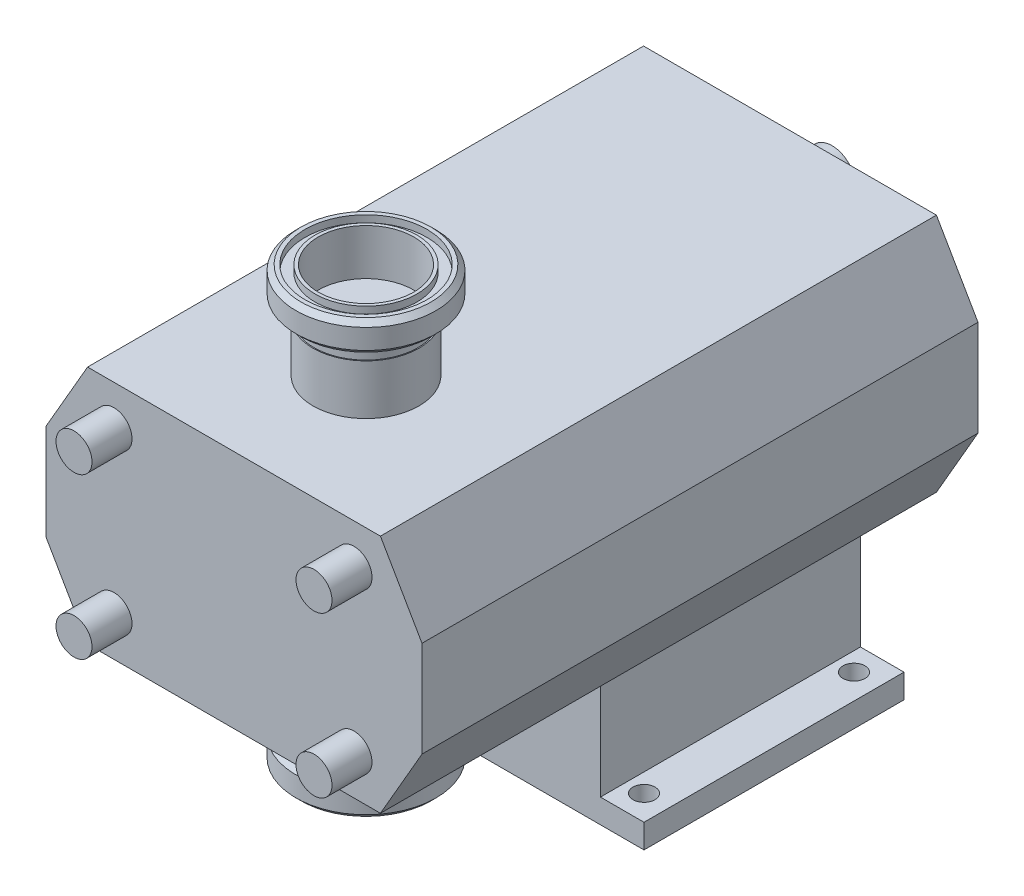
ISO-10303-21;
HEADER;
FILE_DESCRIPTION(('STEP AP214'),'2;1');
FILE_NAME('part.step','',(''),(''),'','','');
FILE_SCHEMA(('AUTOMOTIVE_DESIGN { 1 0 10303 214 1 1 1 1 }'));
ENDSEC;
DATA;
#1=APPLICATION_CONTEXT('core data for automotive mechanical design processes');
#2=APPLICATION_PROTOCOL_DEFINITION('international standard','automotive_design',2000,#1);
#3=PRODUCT_CONTEXT('',#1,'mechanical');
#4=PRODUCT('Part','Part','',(#3));
#5=PRODUCT_RELATED_PRODUCT_CATEGORY('part','',(#4));
#6=PRODUCT_DEFINITION_FORMATION('','',#4);
#7=PRODUCT_DEFINITION_CONTEXT('part definition',#1,'design');
#8=PRODUCT_DEFINITION('design','',#6,#7);
#9=PRODUCT_DEFINITION_SHAPE('','',#8);
#10=(LENGTH_UNIT() NAMED_UNIT(*) SI_UNIT(.MILLI.,.METRE.));
#11=(NAMED_UNIT(*) PLANE_ANGLE_UNIT() SI_UNIT($,.RADIAN.));
#12=(NAMED_UNIT(*) SI_UNIT($,.STERADIAN.) SOLID_ANGLE_UNIT());
#13=UNCERTAINTY_MEASURE_WITH_UNIT(LENGTH_MEASURE(1.E-05),#10,'distance_accuracy_value','');
#14=(GEOMETRIC_REPRESENTATION_CONTEXT(3) GLOBAL_UNCERTAINTY_ASSIGNED_CONTEXT((#13)) GLOBAL_UNIT_ASSIGNED_CONTEXT((#10,
#11,#12)) REPRESENTATION_CONTEXT('',''));
#15=CARTESIAN_POINT('',(0.,0.,0.));
#16=DIRECTION('',(0.,0.,1.));
#17=DIRECTION('',(1.,0.,0.));
#18=AXIS2_PLACEMENT_3D('',#15,#16,#17);
#19=CARTESIAN_POINT('',(25.267696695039,104.5,215.434167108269));
#20=DIRECTION('',(0.,1.,0.));
#21=DIRECTION('',(-0.134673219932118,0.,0.990890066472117));
#22=AXIS2_PLACEMENT_3D('',#19,#20,#21);
#23=PLANE('',#22);
#24=CARTESIAN_POINT('',(0.,104.5,212.));
#25=DIRECTION('',(0.,-1.,0.));
#26=DIRECTION('',(0.134673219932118,0.,-0.990890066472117));
#27=AXIS2_PLACEMENT_3D('',#24,#25,#26);
#28=CIRCLE('',#27,25.5);
#29=CARTESIAN_POINT('',(3.43416710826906,104.5,186.732303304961));
#30=VERTEX_POINT('',#29);
#31=EDGE_CURVE('P0_E57',#30,#30,#28,.T.);
#32=ORIENTED_EDGE('',*,*,#31,.T.);
#33=EDGE_LOOP('',(#32));
#34=FACE_BOUND('',#33,.T.);
#35=CARTESIAN_POINT('',(0.,104.5,212.));
#36=DIRECTION('',(0.,-1.,0.));
#37=DIRECTION('',(0.134673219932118,0.,-0.990890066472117));
#38=AXIS2_PLACEMENT_3D('',#35,#36,#37);
#39=CIRCLE('',#38,30.5);
#40=CARTESIAN_POINT('',(4.10753320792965,104.5,181.7778529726));
#41=VERTEX_POINT('',#40);
#42=EDGE_CURVE('P0_E9',#41,#41,#39,.T.);
#43=ORIENTED_EDGE('',*,*,#42,.F.);
#44=EDGE_LOOP('',(#43));
#45=FACE_BOUND('',#44,.T.);
#46=ADVANCED_FACE('P0_F14',(#34,#45),#23,.T.);
#47=CARTESIAN_POINT('',(0.,85.,212.));
#48=DIRECTION('',(0.,-1.,0.));
#49=DIRECTION('',(0.134673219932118,0.,-0.990890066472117));
#50=AXIS2_PLACEMENT_3D('',#47,#48,#49);
#51=CYLINDRICAL_SURFACE('',#50,30.5);
#52=ORIENTED_EDGE('',*,*,#42,.T.);
#53=EDGE_LOOP('',(#52));
#54=FACE_BOUND('',#53,.T.);
#55=CARTESIAN_POINT('',(0.,108.,212.));
#56=DIRECTION('',(0.,-1.,0.));
#57=DIRECTION('',(0.134673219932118,0.,-0.990890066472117));
#58=AXIS2_PLACEMENT_3D('',#55,#56,#57);
#59=CIRCLE('',#58,30.5);
#60=CARTESIAN_POINT('',(4.10753320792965,108.,181.7778529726));
#61=VERTEX_POINT('',#60);
#62=EDGE_CURVE('P0_E20',#61,#61,#59,.T.);
#63=ORIENTED_EDGE('',*,*,#62,.F.);
#64=EDGE_LOOP('',(#63));
#65=FACE_BOUND('',#64,.T.);
#66=ADVANCED_FACE('P0_F76',(#54,#65),#51,.F.);
#67=CARTESIAN_POINT('',(30.2221470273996,108.,216.10753320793));
#68=DIRECTION('',(0.,1.,0.));
#69=DIRECTION('',(-0.134673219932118,0.,0.990890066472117));
#70=AXIS2_PLACEMENT_3D('',#67,#68,#69);
#71=PLANE('',#70);
#72=ORIENTED_EDGE('',*,*,#62,.T.);
#73=EDGE_LOOP('',(#72));
#74=FACE_BOUND('',#73,.T.);
#75=CARTESIAN_POINT('',(0.,108.,212.));
#76=DIRECTION('',(0.,-1.,0.));
#77=DIRECTION('',(0.134673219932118,0.,-0.990890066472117));
#78=AXIS2_PLACEMENT_3D('',#75,#76,#77);
#79=CIRCLE('',#78,32.5);
#80=CARTESIAN_POINT('',(4.37687964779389,108.,179.796072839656));
#81=VERTEX_POINT('',#80);
#82=EDGE_CURVE('P0_E24',#81,#81,#79,.T.);
#83=ORIENTED_EDGE('',*,*,#82,.F.);
#84=EDGE_LOOP('',(#83));
#85=FACE_BOUND('',#84,.T.);
#86=ADVANCED_FACE('P0_F80',(#74,#85),#71,.T.);
#87=CARTESIAN_POINT('',(0.,105.5,212.));
#88=DIRECTION('',(0.,-1.,0.));
#89=DIRECTION('',(0.134673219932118,0.,-0.990890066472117));
#90=AXIS2_PLACEMENT_3D('',#87,#88,#89);
#91=CONICAL_SURFACE('',#90,35.,0.785398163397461);
#92=ORIENTED_EDGE('',*,*,#82,.T.);
#93=EDGE_LOOP('',(#92));
#94=FACE_BOUND('',#93,.T.);
#95=CARTESIAN_POINT('',(0.,105.5,212.));
#96=DIRECTION('',(0.,-1.,0.));
#97=DIRECTION('',(0.134673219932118,0.,-0.990890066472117));
#98=AXIS2_PLACEMENT_3D('',#95,#96,#97);
#99=CIRCLE('',#98,35.);
#100=CARTESIAN_POINT('',(4.71356269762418,105.5,177.318847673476));
#101=VERTEX_POINT('',#100);
#102=EDGE_CURVE('P0_E28',#101,#101,#99,.T.);
#103=ORIENTED_EDGE('',*,*,#102,.F.);
#104=EDGE_LOOP('',(#103));
#105=FACE_BOUND('',#104,.T.);
#106=ADVANCED_FACE('P0_F84',(#94,#105),#91,.T.);
#107=CARTESIAN_POINT('',(0.,85.,212.));
#108=DIRECTION('',(0.,-1.,0.));
#109=DIRECTION('',(0.134673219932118,0.,-0.990890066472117));
#110=AXIS2_PLACEMENT_3D('',#107,#108,#109);
#111=CYLINDRICAL_SURFACE('',#110,35.);
#112=ORIENTED_EDGE('',*,*,#102,.T.);
#113=EDGE_LOOP('',(#112));
#114=FACE_BOUND('',#113,.T.);
#115=CARTESIAN_POINT('',(0.,95.5,212.));
#116=DIRECTION('',(0.,-1.,0.));
#117=DIRECTION('',(0.134673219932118,0.,-0.990890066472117));
#118=AXIS2_PLACEMENT_3D('',#115,#116,#117);
#119=CIRCLE('',#118,35.);
#120=CARTESIAN_POINT('',(4.71356269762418,95.5,177.318847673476));
#121=VERTEX_POINT('',#120);
#122=EDGE_CURVE('P0_E33',#121,#121,#119,.T.);
#123=ORIENTED_EDGE('',*,*,#122,.F.);
#124=EDGE_LOOP('',(#123));
#125=FACE_BOUND('',#124,.T.);
#126=ADVANCED_FACE('P0_F90',(#114,#125),#111,.T.);
#127=CARTESIAN_POINT('',(0.,93.,212.));
#128=DIRECTION('',(0.,1.,0.));
#129=DIRECTION('',(-0.134673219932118,0.,0.990890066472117));
#130=AXIS2_PLACEMENT_3D('',#127,#128,#129);
#131=CONICAL_SURFACE('',#130,32.5,0.785398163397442);
#132=ORIENTED_EDGE('',*,*,#122,.T.);
#133=EDGE_LOOP('',(#132));
#134=FACE_BOUND('',#133,.T.);
#135=CARTESIAN_POINT('',(0.,93.,212.));
#136=DIRECTION('',(0.,-1.,0.));
#137=DIRECTION('',(0.134673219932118,0.,-0.990890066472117));
#138=AXIS2_PLACEMENT_3D('',#135,#136,#137);
#139=CIRCLE('',#138,32.5);
#140=CARTESIAN_POINT('',(4.37687964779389,93.,179.796072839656));
#141=VERTEX_POINT('',#140);
#142=EDGE_CURVE('P0_E36',#141,#141,#139,.T.);
#143=ORIENTED_EDGE('',*,*,#142,.F.);
#144=EDGE_LOOP('',(#143));
#145=FACE_BOUND('',#144,.T.);
#146=ADVANCED_FACE('P0_F94',(#134,#145),#131,.T.);
#147=CARTESIAN_POINT('',(32.2039271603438,93.,216.376879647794));
#148=DIRECTION('',(0.,-1.,0.));
#149=DIRECTION('',(0.134673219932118,0.,-0.990890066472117));
#150=AXIS2_PLACEMENT_3D('',#147,#148,#149);
#151=PLANE('',#150);
#152=ORIENTED_EDGE('',*,*,#142,.T.);
#153=EDGE_LOOP('',(#152));
#154=FACE_BOUND('',#153,.T.);
#155=CARTESIAN_POINT('',(0.,93.,212.));
#156=DIRECTION('',(0.,-1.,0.));
#157=DIRECTION('',(0.134673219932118,0.,-0.990890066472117));
#158=AXIS2_PLACEMENT_3D('',#155,#156,#157);
#159=CIRCLE('',#158,28.5);
#160=CARTESIAN_POINT('',(3.83818676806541,93.,183.759633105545));
#161=VERTEX_POINT('',#160);
#162=EDGE_CURVE('P0_E39',#161,#161,#159,.T.);
#163=ORIENTED_EDGE('',*,*,#162,.F.);
#164=EDGE_LOOP('',(#163));
#165=FACE_BOUND('',#164,.T.);
#166=ADVANCED_FACE('P0_F98',(#154,#165),#151,.T.);
#167=CARTESIAN_POINT('',(0.,90.5,212.));
#168=DIRECTION('',(0.,-1.,0.));
#169=DIRECTION('',(0.134673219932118,0.,-0.990890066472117));
#170=AXIS2_PLACEMENT_3D('',#167,#168,#169);
#171=TOROIDAL_SURFACE('',#170,28.5,2.5);
#172=ORIENTED_EDGE('',*,*,#162,.T.);
#173=EDGE_LOOP('',(#172));
#174=FACE_BOUND('',#173,.T.);
#175=CARTESIAN_POINT('',(0.,90.5,212.));
#176=DIRECTION('',(0.,-1.,0.));
#177=DIRECTION('',(0.134673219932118,0.,-0.990890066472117));
#178=AXIS2_PLACEMENT_3D('',#175,#176,#177);
#179=CIRCLE('',#178,26.);
#180=CARTESIAN_POINT('',(3.50150371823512,90.5,186.236858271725));
#181=VERTEX_POINT('',#180);
#182=EDGE_CURVE('P0_E42',#181,#181,#179,.T.);
#183=ORIENTED_EDGE('',*,*,#182,.F.);
#184=EDGE_LOOP('',(#183));
#185=FACE_BOUND('',#184,.T.);
#186=ADVANCED_FACE('P0_F102',(#174,#185),#171,.F.);
#187=CARTESIAN_POINT('',(0.,85.,212.));
#188=DIRECTION('',(0.,-1.,0.));
#189=DIRECTION('',(0.134673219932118,0.,-0.990890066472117));
#190=AXIS2_PLACEMENT_3D('',#187,#188,#189);
#191=CYLINDRICAL_SURFACE('',#190,26.);
#192=ORIENTED_EDGE('',*,*,#182,.T.);
#193=EDGE_LOOP('',(#192));
#194=FACE_BOUND('',#193,.T.);
#195=CARTESIAN_POINT('',(0.,85.,212.));
#196=DIRECTION('',(0.,-1.,0.));
#197=DIRECTION('',(0.134673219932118,0.,-0.990890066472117));
#198=AXIS2_PLACEMENT_3D('',#195,#196,#197);
#199=CIRCLE('',#198,26.);
#200=CARTESIAN_POINT('',(3.50150371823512,85.,186.236858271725));
#201=VERTEX_POINT('',#200);
#202=EDGE_CURVE('P0_E45',#201,#201,#199,.T.);
#203=ORIENTED_EDGE('',*,*,#202,.F.);
#204=EDGE_LOOP('',(#203));
#205=FACE_BOUND('',#204,.T.);
#206=ADVANCED_FACE('P0_F106',(#194,#205),#191,.T.);
#207=CARTESIAN_POINT('',(25.7631417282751,85.,215.501503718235));
#208=DIRECTION('',(0.,-1.,0.));
#209=DIRECTION('',(0.134673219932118,0.,-0.990890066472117));
#210=AXIS2_PLACEMENT_3D('',#207,#208,#209);
#211=PLANE('',#210);
#212=ORIENTED_EDGE('',*,*,#202,.T.);
#213=EDGE_LOOP('',(#212));
#214=FACE_BOUND('',#213,.T.);
#215=CARTESIAN_POINT('',(0.,85.,212.));
#216=DIRECTION('',(0.,-1.,0.));
#217=DIRECTION('',(0.134673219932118,0.,-0.990890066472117));
#218=AXIS2_PLACEMENT_3D('',#215,#216,#217);
#219=CIRCLE('',#218,23.9);
#220=CARTESIAN_POINT('',(3.21868995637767,85.,188.317727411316));
#221=VERTEX_POINT('',#220);
#222=EDGE_CURVE('P0_E48',#221,#221,#219,.T.);
#223=ORIENTED_EDGE('',*,*,#222,.F.);
#224=EDGE_LOOP('',(#223));
#225=FACE_BOUND('',#224,.T.);
#226=ADVANCED_FACE('P0_F110',(#214,#225),#211,.T.);
#227=CARTESIAN_POINT('',(0.,85.,212.));
#228=DIRECTION('',(0.,-1.,0.));
#229=DIRECTION('',(0.134673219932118,0.,-0.990890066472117));
#230=AXIS2_PLACEMENT_3D('',#227,#228,#229);
#231=CYLINDRICAL_SURFACE('',#230,23.9);
#232=ORIENTED_EDGE('',*,*,#222,.T.);
#233=EDGE_LOOP('',(#232));
#234=FACE_BOUND('',#233,.T.);
#235=CARTESIAN_POINT('',(0.,108.,212.));
#236=DIRECTION('',(0.,-1.,0.));
#237=DIRECTION('',(0.134673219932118,0.,-0.990890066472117));
#238=AXIS2_PLACEMENT_3D('',#235,#236,#237);
#239=CIRCLE('',#238,23.9);
#240=CARTESIAN_POINT('',(3.21868995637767,108.,188.317727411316));
#241=VERTEX_POINT('',#240);
#242=EDGE_CURVE('P0_E51',#241,#241,#239,.T.);
#243=ORIENTED_EDGE('',*,*,#242,.F.);
#244=EDGE_LOOP('',(#243));
#245=FACE_BOUND('',#244,.T.);
#246=ADVANCED_FACE('P0_F72',(#234,#245),#231,.F.);
#247=CARTESIAN_POINT('',(23.6822725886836,108.,215.218689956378));
#248=DIRECTION('',(0.,1.,0.));
#249=DIRECTION('',(-0.134673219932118,0.,0.990890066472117));
#250=AXIS2_PLACEMENT_3D('',#247,#248,#249);
#251=PLANE('',#250);
#252=ORIENTED_EDGE('',*,*,#242,.T.);
#253=EDGE_LOOP('',(#252));
#254=FACE_BOUND('',#253,.T.);
#255=CARTESIAN_POINT('',(0.,108.,212.));
#256=DIRECTION('',(0.,-1.,0.));
#257=DIRECTION('',(0.134673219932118,0.,-0.990890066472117));
#258=AXIS2_PLACEMENT_3D('',#255,#256,#257);
#259=CIRCLE('',#258,25.5);
#260=CARTESIAN_POINT('',(3.43416710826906,108.,186.732303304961));
#261=VERTEX_POINT('',#260);
#262=EDGE_CURVE('P0_E54',#261,#261,#259,.T.);
#263=ORIENTED_EDGE('',*,*,#262,.F.);
#264=EDGE_LOOP('',(#263));
#265=FACE_BOUND('',#264,.T.);
#266=ADVANCED_FACE('P0_F65',(#254,#265),#251,.T.);
#267=CARTESIAN_POINT('',(0.,85.,212.));
#268=DIRECTION('',(0.,-1.,0.));
#269=DIRECTION('',(0.134673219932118,0.,-0.990890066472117));
#270=AXIS2_PLACEMENT_3D('',#267,#268,#269);
#271=CYLINDRICAL_SURFACE('',#270,25.5);
#272=ORIENTED_EDGE('',*,*,#262,.T.);
#273=EDGE_LOOP('',(#272));
#274=FACE_BOUND('',#273,.T.);
#275=ORIENTED_EDGE('',*,*,#31,.F.);
#276=EDGE_LOOP('',(#275));
#277=FACE_BOUND('',#276,.T.);
#278=ADVANCED_FACE('P0_F63',(#274,#277),#271,.T.);
#279=CLOSED_SHELL('',(#46,#66,#86,#106,#126,#146,#166,#186,#206,#226,#246,#266,#278));
#280=MANIFOLD_SOLID_BREP('P0_B1',#279);
#281=CARTESIAN_POINT('',(-31.,0.,241.732657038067));
#282=DIRECTION('',(0.,0.,1.));
#283=DIRECTION('',(1.,0.,0.));
#284=AXIS2_PLACEMENT_3D('',#281,#282,#283);
#285=CYLINDRICAL_SURFACE('',#284,12.);
#286=CARTESIAN_POINT('',(-31.,0.,-2.));
#287=DIRECTION('',(0.,0.,1.));
#288=DIRECTION('',(1.,0.,0.));
#289=AXIS2_PLACEMENT_3D('',#286,#287,#288);
#290=CIRCLE('',#289,12.);
#291=CARTESIAN_POINT('',(-19.,0.,-2.));
#292=VERTEX_POINT('',#291);
#293=EDGE_CURVE('P1_E277',#292,#292,#290,.T.);
#294=ORIENTED_EDGE('',*,*,#293,.F.);
#295=EDGE_LOOP('',(#294));
#296=FACE_BOUND('',#295,.T.);
#297=DIRECTION('',(0.,0.,1.));
#298=VECTOR('',#297,1.);
#299=CARTESIAN_POINT('',(-19.6862915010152,3.99999999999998,241.732657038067));
#300=LINE('',#299,#298);
#301=CARTESIAN_POINT('',(-19.6862915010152,4.,-52.));
#302=VERTEX_POINT('',#301);
#303=CARTESIAN_POINT('',(-19.6862915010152,4.,-22.));
#304=VERTEX_POINT('',#303);
#305=EDGE_CURVE('P1_E178',#302,#304,#300,.T.);
#306=ORIENTED_EDGE('',*,*,#305,.F.);
#307=CARTESIAN_POINT('',(-31.,0.,-52.));
#308=DIRECTION('',(0.,0.,1.));
#309=DIRECTION('',(1.,0.,0.));
#310=AXIS2_PLACEMENT_3D('',#307,#308,#309);
#311=CIRCLE('',#310,12.);
#312=CARTESIAN_POINT('',(-19.6862915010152,-4.,-52.));
#313=VERTEX_POINT('',#312);
#314=EDGE_CURVE('P1_E176',#302,#313,#311,.T.);
#315=ORIENTED_EDGE('',*,*,#314,.T.);
#316=DIRECTION('',(0.,0.,1.));
#317=VECTOR('',#316,1.);
#318=CARTESIAN_POINT('',(-19.6862915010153,-4.00000000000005,241.732657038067));
#319=LINE('',#318,#317);
#320=CARTESIAN_POINT('',(-19.6862915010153,-4.00000000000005,-22.));
#321=VERTEX_POINT('',#320);
#322=EDGE_CURVE('P1_E39',#321,#313,#319,.F.);
#323=ORIENTED_EDGE('',*,*,#322,.F.);
#324=CARTESIAN_POINT('',(-19.,0.,-26.));
#325=CARTESIAN_POINT('',(-18.9999993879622,0.218253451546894,-26.0000010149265));
#326=CARTESIAN_POINT('',(-19.0060092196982,0.436500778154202,-25.9820789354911));
#327=CARTESIAN_POINT('',(-19.0293915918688,0.866567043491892,-25.9110835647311));
#328=CARTESIAN_POINT('',(-19.0467653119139,1.07838531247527,-25.8580066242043));
#329=CARTESIAN_POINT('',(-19.0909876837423,1.4893311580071,-25.7187230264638));
#330=CARTESIAN_POINT('',(-19.1178204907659,1.68847930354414,-25.6325717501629));
#331=CARTESIAN_POINT('',(-19.1782221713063,2.0694997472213,-25.4298353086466));
#332=CARTESIAN_POINT('',(-19.2117923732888,2.25136862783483,-25.3132441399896));
#333=CARTESIAN_POINT('',(-19.2834362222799,2.59896670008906,-25.048696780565));
#334=CARTESIAN_POINT('',(-19.3216177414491,2.76401480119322,-24.899875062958));
#335=CARTESIAN_POINT('',(-19.3975874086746,3.06733077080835,-24.5769313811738));
#336=CARTESIAN_POINT('',(-19.4353754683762,3.20559274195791,-24.4028038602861));
#337=CARTESIAN_POINT('',(-19.5074667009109,3.45529976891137,-24.028059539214));
#338=CARTESIAN_POINT('',(-19.5416384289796,3.5658594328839,-23.826825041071));
#339=CARTESIAN_POINT('',(-19.6009877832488,3.75127549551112,-23.4072956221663));
#340=CARTESIAN_POINT('',(-19.6261681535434,3.82614278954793,-23.1890059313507));
#341=CARTESIAN_POINT('',(-19.6635478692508,3.93549384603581,-22.7493071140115));
#342=CARTESIAN_POINT('',(-19.6761561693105,3.97125379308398,-22.5282511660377));
#343=CARTESIAN_POINT('',(-19.6881737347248,4.005364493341,-22.0829449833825));
#344=CARTESIAN_POINT('',(-19.687587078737,4.00372680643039,-21.8586957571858));
#345=CARTESIAN_POINT('',(-19.6736394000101,3.96407961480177,-21.4242534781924));
#346=CARTESIAN_POINT('',(-19.6608633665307,3.92773565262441,-21.2138863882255));
#347=CARTESIAN_POINT('',(-19.6249336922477,3.82242465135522,-20.8024263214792));
#348=CARTESIAN_POINT('',(-19.6017788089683,3.75345370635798,-20.601334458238));
#349=CARTESIAN_POINT('',(-19.5472835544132,3.58375623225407,-20.2103490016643));
#350=CARTESIAN_POINT('',(-19.5158173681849,3.4825361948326,-20.02068789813));
#351=CARTESIAN_POINT('',(-19.4482976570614,3.251556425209,-19.660516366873));
#352=CARTESIAN_POINT('',(-19.4122428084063,3.12178844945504,-19.4900114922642));
#353=CARTESIAN_POINT('',(-19.3373068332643,2.82939733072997,-19.1636336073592));
#354=CARTESIAN_POINT('',(-19.2983764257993,2.66541260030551,-19.0089892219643));
#355=CARTESIAN_POINT('',(-19.2237224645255,2.31335827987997,-18.7290749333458));
#356=CARTESIAN_POINT('',(-19.1879992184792,2.12528638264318,-18.6038078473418));
#357=CARTESIAN_POINT('',(-19.1233156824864,1.72779045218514,-18.3852147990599));
#358=CARTESIAN_POINT('',(-19.0944259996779,1.51817310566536,-18.2922180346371));
#359=CARTESIAN_POINT('',(-19.0471773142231,1.085076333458,-18.1431873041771));
#360=CARTESIAN_POINT('',(-19.028814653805,0.861601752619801,-18.0871404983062));
#361=CARTESIAN_POINT('',(-19.0052949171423,0.417535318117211,-18.0157773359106));
#362=CARTESIAN_POINT('',(-18.9995999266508,0.197238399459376,-17.998800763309));
#363=CARTESIAN_POINT('',(-19.0004438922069,-0.24310027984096,-18.0013306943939));
#364=CARTESIAN_POINT('',(-19.0069807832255,-0.463142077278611,-18.0208310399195));
#365=CARTESIAN_POINT('',(-19.0311990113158,-0.89007946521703,-18.0944476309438));
#366=CARTESIAN_POINT('',(-19.0485520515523,-1.09717122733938,-18.147544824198));
#367=CARTESIAN_POINT('',(-19.0923261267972,-1.4994238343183,-18.2855737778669));
#368=CARTESIAN_POINT('',(-19.118748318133,-1.69458315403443,-18.3705095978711));
#369=CARTESIAN_POINT('',(-19.1788427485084,-2.0731531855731,-18.5722817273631));
#370=CARTESIAN_POINT('',(-19.2126874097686,-2.25611983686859,-18.6898983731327));
#371=CARTESIAN_POINT('',(-19.2837898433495,-2.60025932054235,-18.9527766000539));
#372=CARTESIAN_POINT('',(-19.3210486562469,-2.76142547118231,-19.0980466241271));
#373=CARTESIAN_POINT('',(-19.3969260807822,-3.06501003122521,-19.4199150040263));
#374=CARTESIAN_POINT('',(-19.4355295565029,-3.20624387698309,-19.5976369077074));
#375=CARTESIAN_POINT('',(-19.5080010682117,-3.45703008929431,-19.9750862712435));
#376=CARTESIAN_POINT('',(-19.5418690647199,-3.56658219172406,-20.1748139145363));
#377=CARTESIAN_POINT('',(-19.6007043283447,-3.75038772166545,-20.5906920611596));
#378=CARTESIAN_POINT('',(-19.6256895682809,-3.82471252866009,-20.8068083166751));
#379=CARTESIAN_POINT('',(-19.663566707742,-3.93557866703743,-21.2495146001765));
#380=CARTESIAN_POINT('',(-19.6764640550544,-3.97213701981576,-21.4760998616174));
#381=CARTESIAN_POINT('',(-19.6880856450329,-4.00510512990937,-21.9207883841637));
#382=CARTESIAN_POINT('',(-19.6875039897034,-4.0034810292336,-22.1387293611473));
#383=CARTESIAN_POINT('',(-19.6739492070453,-3.96496917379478,-22.5710602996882));
#384=CARTESIAN_POINT('',(-19.6609768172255,-3.92808351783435,-22.7854504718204));
#385=CARTESIAN_POINT('',(-19.6246190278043,-3.82148725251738,-23.2005426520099));
#386=CARTESIAN_POINT('',(-19.6014360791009,-3.75241338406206,-23.401427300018));
#387=CARTESIAN_POINT('',(-19.5473440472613,-3.58391746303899,-23.7889096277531));
#388=CARTESIAN_POINT('',(-19.5164332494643,-3.48448867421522,-23.975504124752));
#389=CARTESIAN_POINT('',(-19.4486868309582,-3.25304277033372,-24.3379346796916));
#390=CARTESIAN_POINT('',(-19.4116515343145,-3.11979297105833,-24.5129460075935));
#391=CARTESIAN_POINT('',(-19.3366657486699,-2.8265715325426,-24.8387592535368));
#392=CARTESIAN_POINT('',(-19.2987150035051,-2.66659233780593,-24.9895543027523));
#393=CARTESIAN_POINT('',(-19.2243987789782,-2.31696622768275,-25.2685776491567));
#394=CARTESIAN_POINT('',(-19.1881527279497,-2.12640605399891,-25.395697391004));
#395=CARTESIAN_POINT('',(-19.1229603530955,-1.7254294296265,-25.6159617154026));
#396=CARTESIAN_POINT('',(-19.0940121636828,-1.51501807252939,-25.7091149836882));
#397=CARTESIAN_POINT('',(-19.0477793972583,-1.0899745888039,-25.8548865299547));
#398=CARTESIAN_POINT('',(-19.0300315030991,-0.875951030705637,-25.9091298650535));
#399=CARTESIAN_POINT('',(-19.0061437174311,-0.441281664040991,-25.9816811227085));
#400=CARTESIAN_POINT('',(-19.0000006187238,-0.220637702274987,-25.9999989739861));
#401=CARTESIAN_POINT('',(-19.,0.,-26.));
#402=B_SPLINE_CURVE_WITH_KNOTS('',3,(#324,#325,#326,#327,#328,#329,#330,#331,#332,#333,#334,
#335,#336,#337,#338,#339,#340,#341,#342,#343,#344,#345,#346,#347,#348,#349,#350,#351,#352,#353,
#354,#355,#356,#357,#358,#359,#360,#361,#362,#363,#364,#365,#366,#367,#368,#369,#370,#371,#372,
#373,#374,#375,#376,#377,#378,#379,#380,#381,#382,#383,#384,#385,#386,#387,#388,#389,#390,#391,
#392,#393,#394,#395,#396,#397,#398,#399,#400,#401),.UNSPECIFIED.,.T.,.F.,(4,2,2,2,2,2,2,2,2,2,2,
2,2,2,2,2,2,2,2,2,2,2,2,2,2,2,2,2,2,2,2,2,2,2,2,2,2,2,4),(0.,0.653948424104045,1.30796474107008,
1.96089069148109,2.6139455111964,3.28738737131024,3.96097733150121,4.65393539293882,
5.34668178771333,6.01607702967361,6.68526535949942,7.32387306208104,7.96255723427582,
8.61152684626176,9.26068410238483,9.94373223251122,10.6268458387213,11.3167362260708,
12.0063867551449,12.6661433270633,13.3257885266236,13.9663263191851,14.6069458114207,
15.264415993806,15.9220872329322,16.6096409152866,17.2972003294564,17.9833605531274,
18.6692113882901,19.3198266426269,19.9704031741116,20.6086234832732,21.2469855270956,
21.9132026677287,22.5796084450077,23.2719864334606,23.9641872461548,24.6254623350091,
25.2865546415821),.UNSPECIFIED.);
#403=EDGE_CURVE('P1_E11',#304,#321,#402,.T.);
#404=ORIENTED_EDGE('',*,*,#403,.F.);
#405=EDGE_LOOP('',(#306,#315,#323,#404));
#406=FACE_BOUND('',#405,.T.);
#407=ADVANCED_FACE('P1_F17',(#296,#406),#285,.T.);
#408=CARTESIAN_POINT('',(-73.2153903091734,-60.,278.));
#409=DIRECTION('',(0.,1.,0.));
#410=DIRECTION('',(-1.,0.,0.));
#411=AXIS2_PLACEMENT_3D('',#408,#409,#410);
#412=PLANE('',#411);
#413=CARTESIAN_POINT('',(0.,-60.,212.));
#414=DIRECTION('',(0.,1.,0.));
#415=DIRECTION('',(-1.,0.,0.));
#416=AXIS2_PLACEMENT_3D('',#413,#414,#415);
#417=CIRCLE('',#416,26.5);
#418=CARTESIAN_POINT('',(-26.5,-60.,212.));
#419=VERTEX_POINT('',#418);
#420=EDGE_CURVE('P1_E192',#419,#419,#417,.T.);
#421=ORIENTED_EDGE('',*,*,#420,.T.);
#422=EDGE_LOOP('',(#421));
#423=FACE_BOUND('',#422,.T.);
#424=DIRECTION('',(1.,0.,0.));
#425=VECTOR('',#424,1.);
#426=CARTESIAN_POINT('',(-73.2153903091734,-60.,0.));
#427=LINE('',#426,#425);
#428=CARTESIAN_POINT('',(-73.2153903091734,-60.,0.));
#429=VERTEX_POINT('',#428);
#430=CARTESIAN_POINT('',(73.2153903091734,-60.,0.));
#431=VERTEX_POINT('',#430);
#432=EDGE_CURVE('P1_E337',#429,#431,#427,.T.);
#433=ORIENTED_EDGE('',*,*,#432,.T.);
#434=DIRECTION('',(0.,0.,-1.));
#435=VECTOR('',#434,1.);
#436=CARTESIAN_POINT('',(73.2153903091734,-60.,278.));
#437=LINE('',#436,#435);
#438=CARTESIAN_POINT('',(73.2153903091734,-60.,278.));
#439=VERTEX_POINT('',#438);
#440=EDGE_CURVE('P1_E347',#439,#431,#437,.T.);
#441=ORIENTED_EDGE('',*,*,#440,.F.);
#442=DIRECTION('',(1.,0.,0.));
#443=VECTOR('',#442,1.);
#444=CARTESIAN_POINT('',(-73.2153903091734,-60.,278.));
#445=LINE('',#444,#443);
#446=CARTESIAN_POINT('',(-73.2153903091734,-60.,278.));
#447=VERTEX_POINT('',#446);
#448=EDGE_CURVE('P1_E320',#447,#439,#445,.T.);
#449=ORIENTED_EDGE('',*,*,#448,.F.);
#450=DIRECTION('',(0.,0.,-1.));
#451=VECTOR('',#450,1.);
#452=CARTESIAN_POINT('',(-73.2153903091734,-60.,278.));
#453=LINE('',#452,#451);
#454=EDGE_CURVE('P1_E350',#447,#429,#453,.T.);
#455=ORIENTED_EDGE('',*,*,#454,.T.);
#456=EDGE_LOOP('',(#433,#441,#449,#455));
#457=FACE_BOUND('',#456,.T.);
#458=DIRECTION('',(1.,0.,0.));
#459=VECTOR('',#458,1.);
#460=CARTESIAN_POINT('',(53.2153903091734,-60.,18.));
#461=LINE('',#460,#459);
#462=CARTESIAN_POINT('',(-53.2153903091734,-60.,18.));
#463=VERTEX_POINT('',#462);
#464=CARTESIAN_POINT('',(53.2153903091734,-60.,18.));
#465=VERTEX_POINT('',#464);
#466=EDGE_CURVE('P1_E220',#463,#465,#461,.T.);
#467=ORIENTED_EDGE('',*,*,#466,.F.);
#468=DIRECTION('',(0.,0.,1.));
#469=VECTOR('',#468,1.);
#470=CARTESIAN_POINT('',(-53.2153903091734,-60.,18.));
#471=LINE('',#470,#469);
#472=CARTESIAN_POINT('',(-53.2153903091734,-60.,148.));
#473=VERTEX_POINT('',#472);
#474=EDGE_CURVE('P1_E238',#463,#473,#471,.T.);
#475=ORIENTED_EDGE('',*,*,#474,.T.);
#476=DIRECTION('',(1.,0.,0.));
#477=VECTOR('',#476,1.);
#478=CARTESIAN_POINT('',(53.2153903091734,-60.,148.));
#479=LINE('',#478,#477);
#480=CARTESIAN_POINT('',(53.2153903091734,-60.,148.));
#481=VERTEX_POINT('',#480);
#482=EDGE_CURVE('P1_E219',#473,#481,#479,.T.);
#483=ORIENTED_EDGE('',*,*,#482,.T.);
#484=DIRECTION('',(0.,0.,1.));
#485=VECTOR('',#484,1.);
#486=CARTESIAN_POINT('',(53.2153903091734,-60.,18.));
#487=LINE('',#486,#485);
#488=EDGE_CURVE('P1_E274',#465,#481,#487,.T.);
#489=ORIENTED_EDGE('',*,*,#488,.F.);
#490=EDGE_LOOP('',(#467,#475,#483,#489));
#491=FACE_BOUND('',#490,.T.);
#492=ADVANCED_FACE('P1_F393',(#423,#457,#491),#412,.F.);
#493=CARTESIAN_POINT('',(107.856406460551,0.,0.));
#494=DIRECTION('',(0.,0.,1.));
#495=DIRECTION('',(1.,0.,0.));
#496=AXIS2_PLACEMENT_3D('',#493,#494,#495);
#497=PLANE('',#496);
#498=DIRECTION('',(-0.500000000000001,0.866025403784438,0.));
#499=VECTOR('',#498,1.);
#500=CARTESIAN_POINT('',(73.2153903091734,60.,0.));
#501=LINE('',#500,#499);
#502=CARTESIAN_POINT('',(94.,24.,0.));
#503=VERTEX_POINT('',#502);
#504=CARTESIAN_POINT('',(73.2153903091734,60.,0.));
#505=VERTEX_POINT('',#504);
#506=EDGE_CURVE('P1_E305',#503,#505,#501,.T.);
#507=ORIENTED_EDGE('',*,*,#506,.F.);
#508=DIRECTION('',(0.,1.,0.));
#509=VECTOR('',#508,1.);
#510=CARTESIAN_POINT('',(94.,24.,0.));
#511=LINE('',#510,#509);
#512=CARTESIAN_POINT('',(94.,-24.,0.));
#513=VERTEX_POINT('',#512);
#514=EDGE_CURVE('P1_E312',#513,#503,#511,.T.);
#515=ORIENTED_EDGE('',*,*,#514,.F.);
#516=DIRECTION('',(0.500000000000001,0.866025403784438,0.));
#517=VECTOR('',#516,1.);
#518=CARTESIAN_POINT('',(73.2153903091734,-60.,0.));
#519=LINE('',#518,#517);
#520=EDGE_CURVE('P1_E339',#431,#513,#519,.T.);
#521=ORIENTED_EDGE('',*,*,#520,.F.);
#522=ORIENTED_EDGE('',*,*,#432,.F.);
#523=DIRECTION('',(0.500000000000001,-0.866025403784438,0.));
#524=VECTOR('',#523,1.);
#525=CARTESIAN_POINT('',(-73.2153903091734,-60.,0.));
#526=LINE('',#525,#524);
#527=CARTESIAN_POINT('',(-94.,-24.,0.));
#528=VERTEX_POINT('',#527);
#529=EDGE_CURVE('P1_E335',#528,#429,#526,.T.);
#530=ORIENTED_EDGE('',*,*,#529,.F.);
#531=DIRECTION('',(0.,-1.,0.));
#532=VECTOR('',#531,1.);
#533=CARTESIAN_POINT('',(-94.,24.,0.));
#534=LINE('',#533,#532);
#535=CARTESIAN_POINT('',(-94.,24.,0.));
#536=VERTEX_POINT('',#535);
#537=EDGE_CURVE('P1_E333',#536,#528,#534,.T.);
#538=ORIENTED_EDGE('',*,*,#537,.F.);
#539=DIRECTION('',(-0.500000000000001,-0.866025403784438,0.));
#540=VECTOR('',#539,1.);
#541=CARTESIAN_POINT('',(-73.2153903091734,60.,0.));
#542=LINE('',#541,#540);
#543=CARTESIAN_POINT('',(-73.2153903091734,60.,0.));
#544=VERTEX_POINT('',#543);
#545=EDGE_CURVE('P1_E331',#544,#536,#542,.T.);
#546=ORIENTED_EDGE('',*,*,#545,.F.);
#547=DIRECTION('',(-1.,0.,0.));
#548=VECTOR('',#547,1.);
#549=CARTESIAN_POINT('',(-73.2153903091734,60.,0.));
#550=LINE('',#549,#548);
#551=EDGE_CURVE('P1_E329',#505,#544,#550,.T.);
#552=ORIENTED_EDGE('',*,*,#551,.F.);
#553=EDGE_LOOP('',(#507,#515,#521,#522,#530,#538,#546,#552));
#554=FACE_BOUND('',#553,.T.);
#555=CARTESIAN_POINT('',(-31.,0.,0.));
#556=DIRECTION('',(0.,0.,1.));
#557=DIRECTION('',(1.,0.,0.));
#558=AXIS2_PLACEMENT_3D('',#555,#556,#557);
#559=CIRCLE('',#558,15.);
#560=CARTESIAN_POINT('',(-16.,0.,0.));
#561=VERTEX_POINT('',#560);
#562=EDGE_CURVE('P1_E29',#561,#561,#559,.F.);
#563=ORIENTED_EDGE('',*,*,#562,.F.);
#564=EDGE_LOOP('',(#563));
#565=FACE_BOUND('',#564,.T.);
#566=ADVANCED_FACE('P1_F399',(#554,#565),#497,.F.);
#567=CARTESIAN_POINT('',(107.856406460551,0.,278.));
#568=DIRECTION('',(0.,0.,1.));
#569=DIRECTION('',(1.,0.,0.));
#570=AXIS2_PLACEMENT_3D('',#567,#568,#569);
#571=PLANE('',#570);
#572=CARTESIAN_POINT('',(60.,-40.,278.));
#573=DIRECTION('',(0.,0.,1.));
#574=DIRECTION('',(1.,0.,0.));
#575=AXIS2_PLACEMENT_3D('',#572,#573,#574);
#576=CIRCLE('',#575,9.);
#577=CARTESIAN_POINT('',(69.,-40.,278.));
#578=VERTEX_POINT('',#577);
#579=EDGE_CURVE('P1_E287',#578,#578,#576,.T.);
#580=ORIENTED_EDGE('',*,*,#579,.F.);
#581=EDGE_LOOP('',(#580));
#582=FACE_BOUND('',#581,.T.);
#583=CARTESIAN_POINT('',(-60.,40.,278.));
#584=DIRECTION('',(0.,0.,1.));
#585=DIRECTION('',(1.,0.,0.));
#586=AXIS2_PLACEMENT_3D('',#583,#584,#585);
#587=CIRCLE('',#586,9.);
#588=CARTESIAN_POINT('',(-51.,40.,278.));
#589=VERTEX_POINT('',#588);
#590=EDGE_CURVE('P1_E299',#589,#589,#587,.T.);
#591=ORIENTED_EDGE('',*,*,#590,.F.);
#592=EDGE_LOOP('',(#591));
#593=FACE_BOUND('',#592,.T.);
#594=DIRECTION('',(-0.500000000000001,0.866025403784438,0.));
#595=VECTOR('',#594,1.);
#596=CARTESIAN_POINT('',(73.2153903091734,60.,278.));
#597=LINE('',#596,#595);
#598=CARTESIAN_POINT('',(94.,24.,278.));
#599=VERTEX_POINT('',#598);
#600=CARTESIAN_POINT('',(73.2153903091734,60.,278.));
#601=VERTEX_POINT('',#600);
#602=EDGE_CURVE('P1_E308',#599,#601,#597,.T.);
#603=ORIENTED_EDGE('',*,*,#602,.T.);
#604=DIRECTION('',(-1.,0.,0.));
#605=VECTOR('',#604,1.);
#606=CARTESIAN_POINT('',(-73.2153903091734,60.,278.));
#607=LINE('',#606,#605);
#608=CARTESIAN_POINT('',(-73.2153903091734,60.,278.));
#609=VERTEX_POINT('',#608);
#610=EDGE_CURVE('P1_E311',#601,#609,#607,.T.);
#611=ORIENTED_EDGE('',*,*,#610,.T.);
#612=DIRECTION('',(-0.500000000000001,-0.866025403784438,0.));
#613=VECTOR('',#612,1.);
#614=CARTESIAN_POINT('',(-73.2153903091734,60.,278.));
#615=LINE('',#614,#613);
#616=CARTESIAN_POINT('',(-94.,24.,278.));
#617=VERTEX_POINT('',#616);
#618=EDGE_CURVE('P1_E314',#609,#617,#615,.T.);
#619=ORIENTED_EDGE('',*,*,#618,.T.);
#620=DIRECTION('',(0.,-1.,0.));
#621=VECTOR('',#620,1.);
#622=CARTESIAN_POINT('',(-94.,24.,278.));
#623=LINE('',#622,#621);
#624=CARTESIAN_POINT('',(-94.,-24.,278.));
#625=VERTEX_POINT('',#624);
#626=EDGE_CURVE('P1_E316',#617,#625,#623,.T.);
#627=ORIENTED_EDGE('',*,*,#626,.T.);
#628=DIRECTION('',(0.500000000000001,-0.866025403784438,0.));
#629=VECTOR('',#628,1.);
#630=CARTESIAN_POINT('',(-73.2153903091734,-60.,278.));
#631=LINE('',#630,#629);
#632=EDGE_CURVE('P1_E318',#625,#447,#631,.T.);
#633=ORIENTED_EDGE('',*,*,#632,.T.);
#634=ORIENTED_EDGE('',*,*,#448,.T.);
#635=DIRECTION('',(0.500000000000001,0.866025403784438,0.));
#636=VECTOR('',#635,1.);
#637=CARTESIAN_POINT('',(73.2153903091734,-60.,278.));
#638=LINE('',#637,#636);
#639=CARTESIAN_POINT('',(94.,-24.,278.));
#640=VERTEX_POINT('',#639);
#641=EDGE_CURVE('P1_E322',#439,#640,#638,.T.);
#642=ORIENTED_EDGE('',*,*,#641,.T.);
#643=DIRECTION('',(0.,1.,0.));
#644=VECTOR('',#643,1.);
#645=CARTESIAN_POINT('',(94.,24.,278.));
#646=LINE('',#645,#644);
#647=EDGE_CURVE('P1_E324',#640,#599,#646,.T.);
#648=ORIENTED_EDGE('',*,*,#647,.T.);
#649=EDGE_LOOP('',(#603,#611,#619,#627,#633,#634,#642,#648));
#650=FACE_BOUND('',#649,.T.);
#651=CARTESIAN_POINT('',(60.,40.,278.));
#652=DIRECTION('',(0.,0.,1.));
#653=DIRECTION('',(1.,0.,0.));
#654=AXIS2_PLACEMENT_3D('',#651,#652,#653);
#655=CIRCLE('',#654,9.);
#656=CARTESIAN_POINT('',(69.,40.,278.));
#657=VERTEX_POINT('',#656);
#658=EDGE_CURVE('P1_E293',#657,#657,#655,.T.);
#659=ORIENTED_EDGE('',*,*,#658,.F.);
#660=EDGE_LOOP('',(#659));
#661=FACE_BOUND('',#660,.T.);
#662=CARTESIAN_POINT('',(-60.,-40.,278.));
#663=DIRECTION('',(0.,0.,1.));
#664=DIRECTION('',(1.,0.,0.));
#665=AXIS2_PLACEMENT_3D('',#662,#663,#664);
#666=CIRCLE('',#665,9.);
#667=CARTESIAN_POINT('',(-51.,-40.,278.));
#668=VERTEX_POINT('',#667);
#669=EDGE_CURVE('P1_E283',#668,#668,#666,.T.);
#670=ORIENTED_EDGE('',*,*,#669,.F.);
#671=EDGE_LOOP('',(#670));
#672=FACE_BOUND('',#671,.T.);
#673=ADVANCED_FACE('P1_F448',(#582,#593,#650,#661,#672),#571,.T.);
#674=CARTESIAN_POINT('',(73.2153903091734,60.,278.));
#675=DIRECTION('',(-0.866025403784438,-0.500000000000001,0.));
#676=DIRECTION('',(0.500000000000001,-0.866025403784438,0.));
#677=AXIS2_PLACEMENT_3D('',#674,#675,#676);
#678=PLANE('',#677);
#679=ORIENTED_EDGE('',*,*,#506,.T.);
#680=DIRECTION('',(0.,0.,-1.));
#681=VECTOR('',#680,1.);
#682=CARTESIAN_POINT('',(73.2153903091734,60.,278.));
#683=LINE('',#682,#681);
#684=EDGE_CURVE('P1_E362',#601,#505,#683,.T.);
#685=ORIENTED_EDGE('',*,*,#684,.F.);
#686=ORIENTED_EDGE('',*,*,#602,.F.);
#687=DIRECTION('',(0.,0.,-1.));
#688=VECTOR('',#687,1.);
#689=CARTESIAN_POINT('',(94.,24.,278.));
#690=LINE('',#689,#688);
#691=EDGE_CURVE('P1_E326',#599,#503,#690,.T.);
#692=ORIENTED_EDGE('',*,*,#691,.T.);
#693=EDGE_LOOP('',(#679,#685,#686,#692));
#694=FACE_BOUND('',#693,.T.);
#695=ADVANCED_FACE('P1_F19',(#694),#678,.F.);
#696=CARTESIAN_POINT('',(-73.2153903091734,60.,278.));
#697=DIRECTION('',(0.,-1.,0.));
#698=DIRECTION('',(1.,0.,0.));
#699=AXIS2_PLACEMENT_3D('',#696,#697,#698);
#700=PLANE('',#699);
#701=CARTESIAN_POINT('',(0.,60.,212.));
#702=DIRECTION('',(0.,-1.,0.));
#703=DIRECTION('',(1.,0.,0.));
#704=AXIS2_PLACEMENT_3D('',#701,#702,#703);
#705=CIRCLE('',#704,26.5);
#706=CARTESIAN_POINT('',(26.5,60.,212.));
#707=VERTEX_POINT('',#706);
#708=EDGE_CURVE('P1_E191',#707,#707,#705,.T.);
#709=ORIENTED_EDGE('',*,*,#708,.T.);
#710=EDGE_LOOP('',(#709));
#711=FACE_BOUND('',#710,.T.);
#712=ORIENTED_EDGE('',*,*,#551,.T.);
#713=DIRECTION('',(0.,0.,-1.));
#714=VECTOR('',#713,1.);
#715=CARTESIAN_POINT('',(-73.2153903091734,60.,278.));
#716=LINE('',#715,#714);
#717=EDGE_CURVE('P1_E359',#609,#544,#716,.T.);
#718=ORIENTED_EDGE('',*,*,#717,.F.);
#719=ORIENTED_EDGE('',*,*,#610,.F.);
#720=ORIENTED_EDGE('',*,*,#684,.T.);
#721=EDGE_LOOP('',(#712,#718,#719,#720));
#722=FACE_BOUND('',#721,.T.);
#723=ADVANCED_FACE('P1_F369',(#711,#722),#700,.F.);
#724=CARTESIAN_POINT('',(-73.2153903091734,60.,278.));
#725=DIRECTION('',(0.866025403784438,-0.500000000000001,0.));
#726=DIRECTION('',(0.500000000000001,0.866025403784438,0.));
#727=AXIS2_PLACEMENT_3D('',#724,#725,#726);
#728=PLANE('',#727);
#729=ORIENTED_EDGE('',*,*,#545,.T.);
#730=DIRECTION('',(0.,0.,-1.));
#731=VECTOR('',#730,1.);
#732=CARTESIAN_POINT('',(-94.,24.,278.));
#733=LINE('',#732,#731);
#734=EDGE_CURVE('P1_E356',#617,#536,#733,.T.);
#735=ORIENTED_EDGE('',*,*,#734,.F.);
#736=ORIENTED_EDGE('',*,*,#618,.F.);
#737=ORIENTED_EDGE('',*,*,#717,.T.);
#738=EDGE_LOOP('',(#729,#735,#736,#737));
#739=FACE_BOUND('',#738,.T.);
#740=ADVANCED_FACE('P1_F469',(#739),#728,.F.);
#741=CARTESIAN_POINT('',(-94.,24.,278.));
#742=DIRECTION('',(1.,0.,0.));
#743=DIRECTION('',(0.,0.,-1.));
#744=AXIS2_PLACEMENT_3D('',#741,#742,#743);
#745=PLANE('',#744);
#746=ORIENTED_EDGE('',*,*,#537,.T.);
#747=DIRECTION('',(0.,0.,-1.));
#748=VECTOR('',#747,1.);
#749=CARTESIAN_POINT('',(-94.,-24.,278.));
#750=LINE('',#749,#748);
#751=EDGE_CURVE('P1_E353',#625,#528,#750,.T.);
#752=ORIENTED_EDGE('',*,*,#751,.F.);
#753=ORIENTED_EDGE('',*,*,#626,.F.);
#754=ORIENTED_EDGE('',*,*,#734,.T.);
#755=EDGE_LOOP('',(#746,#752,#753,#754));
#756=FACE_BOUND('',#755,.T.);
#757=ADVANCED_FACE('P1_F465',(#756),#745,.F.);
#758=CARTESIAN_POINT('',(-73.2153903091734,-60.,278.));
#759=DIRECTION('',(0.866025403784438,0.500000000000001,0.));
#760=DIRECTION('',(-0.500000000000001,0.866025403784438,0.));
#761=AXIS2_PLACEMENT_3D('',#758,#759,#760);
#762=PLANE('',#761);
#763=ORIENTED_EDGE('',*,*,#529,.T.);
#764=ORIENTED_EDGE('',*,*,#454,.F.);
#765=ORIENTED_EDGE('',*,*,#632,.F.);
#766=ORIENTED_EDGE('',*,*,#751,.T.);
#767=EDGE_LOOP('',(#763,#764,#765,#766));
#768=FACE_BOUND('',#767,.T.);
#769=ADVANCED_FACE('P1_F460',(#768),#762,.F.);
#770=CARTESIAN_POINT('',(73.2153903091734,-60.,278.));
#771=DIRECTION('',(-0.866025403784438,0.500000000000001,0.));
#772=DIRECTION('',(-0.500000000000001,-0.866025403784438,0.));
#773=AXIS2_PLACEMENT_3D('',#770,#771,#772);
#774=PLANE('',#773);
#775=ORIENTED_EDGE('',*,*,#520,.T.);
#776=DIRECTION('',(0.,0.,-1.));
#777=VECTOR('',#776,1.);
#778=CARTESIAN_POINT('',(94.,-24.,278.));
#779=LINE('',#778,#777);
#780=EDGE_CURVE('P1_E344',#640,#513,#779,.T.);
#781=ORIENTED_EDGE('',*,*,#780,.F.);
#782=ORIENTED_EDGE('',*,*,#641,.F.);
#783=ORIENTED_EDGE('',*,*,#440,.T.);
#784=EDGE_LOOP('',(#775,#781,#782,#783));
#785=FACE_BOUND('',#784,.T.);
#786=ADVANCED_FACE('P1_F457',(#785),#774,.F.);
#787=CARTESIAN_POINT('',(94.,24.,278.));
#788=DIRECTION('',(-1.,0.,0.));
#789=DIRECTION('',(0.,0.,1.));
#790=AXIS2_PLACEMENT_3D('',#787,#788,#789);
#791=PLANE('',#790);
#792=ORIENTED_EDGE('',*,*,#514,.T.);
#793=ORIENTED_EDGE('',*,*,#691,.F.);
#794=ORIENTED_EDGE('',*,*,#647,.F.);
#795=ORIENTED_EDGE('',*,*,#780,.T.);
#796=EDGE_LOOP('',(#792,#793,#794,#795));
#797=FACE_BOUND('',#796,.T.);
#798=ADVANCED_FACE('P1_F446',(#797),#791,.F.);
#799=CARTESIAN_POINT('',(-60.,40.,298.));
#800=DIRECTION('',(0.,0.,-1.));
#801=DIRECTION('',(-1.,0.,0.));
#802=AXIS2_PLACEMENT_3D('',#799,#800,#801);
#803=CYLINDRICAL_SURFACE('',#802,9.);
#804=CARTESIAN_POINT('',(-60.,40.,298.));
#805=DIRECTION('',(0.,0.,1.));
#806=DIRECTION('',(1.,0.,0.));
#807=AXIS2_PLACEMENT_3D('',#804,#805,#806);
#808=CIRCLE('',#807,9.);
#809=CARTESIAN_POINT('',(-51.,40.,298.));
#810=VERTEX_POINT('',#809);
#811=EDGE_CURVE('P1_E302',#810,#810,#808,.T.);
#812=ORIENTED_EDGE('',*,*,#811,.F.);
#813=EDGE_LOOP('',(#812));
#814=FACE_BOUND('',#813,.T.);
#815=ORIENTED_EDGE('',*,*,#590,.T.);
#816=EDGE_LOOP('',(#815));
#817=FACE_BOUND('',#816,.T.);
#818=ADVANCED_FACE('P1_F442',(#814,#817),#803,.T.);
#819=CARTESIAN_POINT('',(-60.,40.,298.));
#820=DIRECTION('',(0.,0.,1.));
#821=DIRECTION('',(1.,0.,0.));
#822=AXIS2_PLACEMENT_3D('',#819,#820,#821);
#823=PLANE('',#822);
#824=ORIENTED_EDGE('',*,*,#811,.T.);
#825=EDGE_LOOP('',(#824));
#826=FACE_BOUND('',#825,.T.);
#827=ADVANCED_FACE('P1_F438',(#826),#823,.T.);
#828=CARTESIAN_POINT('',(60.,40.,298.));
#829=DIRECTION('',(0.,0.,-1.));
#830=DIRECTION('',(-1.,0.,0.));
#831=AXIS2_PLACEMENT_3D('',#828,#829,#830);
#832=CYLINDRICAL_SURFACE('',#831,9.);
#833=CARTESIAN_POINT('',(60.,40.,298.));
#834=DIRECTION('',(0.,0.,1.));
#835=DIRECTION('',(1.,0.,0.));
#836=AXIS2_PLACEMENT_3D('',#833,#834,#835);
#837=CIRCLE('',#836,9.);
#838=CARTESIAN_POINT('',(69.,40.,298.));
#839=VERTEX_POINT('',#838);
#840=EDGE_CURVE('P1_E296',#839,#839,#837,.T.);
#841=ORIENTED_EDGE('',*,*,#840,.F.);
#842=EDGE_LOOP('',(#841));
#843=FACE_BOUND('',#842,.T.);
#844=ORIENTED_EDGE('',*,*,#658,.T.);
#845=EDGE_LOOP('',(#844));
#846=FACE_BOUND('',#845,.T.);
#847=ADVANCED_FACE('P1_F434',(#843,#846),#832,.T.);
#848=CARTESIAN_POINT('',(60.,40.,298.));
#849=DIRECTION('',(0.,0.,1.));
#850=DIRECTION('',(1.,0.,0.));
#851=AXIS2_PLACEMENT_3D('',#848,#849,#850);
#852=PLANE('',#851);
#853=ORIENTED_EDGE('',*,*,#840,.T.);
#854=EDGE_LOOP('',(#853));
#855=FACE_BOUND('',#854,.T.);
#856=ADVANCED_FACE('P1_F430',(#855),#852,.T.);
#857=CARTESIAN_POINT('',(60.,-40.,298.));
#858=DIRECTION('',(0.,0.,-1.));
#859=DIRECTION('',(-1.,0.,0.));
#860=AXIS2_PLACEMENT_3D('',#857,#858,#859);
#861=CYLINDRICAL_SURFACE('',#860,9.);
#862=CARTESIAN_POINT('',(60.,-40.,298.));
#863=DIRECTION('',(0.,0.,1.));
#864=DIRECTION('',(1.,0.,0.));
#865=AXIS2_PLACEMENT_3D('',#862,#863,#864);
#866=CIRCLE('',#865,9.);
#867=CARTESIAN_POINT('',(69.,-40.,298.));
#868=VERTEX_POINT('',#867);
#869=EDGE_CURVE('P1_E290',#868,#868,#866,.T.);
#870=ORIENTED_EDGE('',*,*,#869,.F.);
#871=EDGE_LOOP('',(#870));
#872=FACE_BOUND('',#871,.T.);
#873=ORIENTED_EDGE('',*,*,#579,.T.);
#874=EDGE_LOOP('',(#873));
#875=FACE_BOUND('',#874,.T.);
#876=ADVANCED_FACE('P1_F426',(#872,#875),#861,.T.);
#877=CARTESIAN_POINT('',(60.,-40.,298.));
#878=DIRECTION('',(0.,0.,1.));
#879=DIRECTION('',(1.,0.,0.));
#880=AXIS2_PLACEMENT_3D('',#877,#878,#879);
#881=PLANE('',#880);
#882=ORIENTED_EDGE('',*,*,#869,.T.);
#883=EDGE_LOOP('',(#882));
#884=FACE_BOUND('',#883,.T.);
#885=ADVANCED_FACE('P1_F422',(#884),#881,.T.);
#886=CARTESIAN_POINT('',(-60.,-40.,298.));
#887=DIRECTION('',(0.,0.,-1.));
#888=DIRECTION('',(-1.,0.,0.));
#889=AXIS2_PLACEMENT_3D('',#886,#887,#888);
#890=CYLINDRICAL_SURFACE('',#889,9.);
#891=CARTESIAN_POINT('',(-60.,-40.,298.));
#892=DIRECTION('',(0.,0.,1.));
#893=DIRECTION('',(1.,0.,0.));
#894=AXIS2_PLACEMENT_3D('',#891,#892,#893);
#895=CIRCLE('',#894,9.);
#896=CARTESIAN_POINT('',(-51.,-40.,298.));
#897=VERTEX_POINT('',#896);
#898=EDGE_CURVE('P1_E284',#897,#897,#895,.T.);
#899=ORIENTED_EDGE('',*,*,#898,.F.);
#900=EDGE_LOOP('',(#899));
#901=FACE_BOUND('',#900,.T.);
#902=ORIENTED_EDGE('',*,*,#669,.T.);
#903=EDGE_LOOP('',(#902));
#904=FACE_BOUND('',#903,.T.);
#905=ADVANCED_FACE('P1_F418',(#901,#904),#890,.T.);
#906=CARTESIAN_POINT('',(-60.,-40.,298.));
#907=DIRECTION('',(0.,0.,1.));
#908=DIRECTION('',(1.,0.,0.));
#909=AXIS2_PLACEMENT_3D('',#906,#907,#908);
#910=PLANE('',#909);
#911=ORIENTED_EDGE('',*,*,#898,.T.);
#912=EDGE_LOOP('',(#911));
#913=FACE_BOUND('',#912,.T.);
#914=ADVANCED_FACE('P1_F414',(#913),#910,.T.);
#915=CARTESIAN_POINT('',(-31.,0.,241.732657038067));
#916=DIRECTION('',(0.,0.,1.));
#917=DIRECTION('',(1.,0.,0.));
#918=AXIS2_PLACEMENT_3D('',#915,#916,#917);
#919=CYLINDRICAL_SURFACE('',#918,15.);
#920=ORIENTED_EDGE('',*,*,#562,.T.);
#921=EDGE_LOOP('',(#920));
#922=FACE_BOUND('',#921,.T.);
#923=CARTESIAN_POINT('',(-31.,0.,-2.));
#924=DIRECTION('',(0.,0.,1.));
#925=DIRECTION('',(1.,0.,0.));
#926=AXIS2_PLACEMENT_3D('',#923,#924,#925);
#927=CIRCLE('',#926,15.);
#928=CARTESIAN_POINT('',(-16.,0.,-2.));
#929=VERTEX_POINT('',#928);
#930=EDGE_CURVE('P1_E280',#929,#929,#927,.T.);
#931=ORIENTED_EDGE('',*,*,#930,.T.);
#932=EDGE_LOOP('',(#931));
#933=FACE_BOUND('',#932,.T.);
#934=ADVANCED_FACE('P1_F410',(#922,#933),#919,.T.);
#935=CARTESIAN_POINT('',(-31.,15.,-2.));
#936=DIRECTION('',(0.,0.,1.));
#937=DIRECTION('',(1.,0.,0.));
#938=AXIS2_PLACEMENT_3D('',#935,#936,#937);
#939=PLANE('',#938);
#940=ORIENTED_EDGE('',*,*,#930,.F.);
#941=EDGE_LOOP('',(#940));
#942=FACE_BOUND('',#941,.T.);
#943=ORIENTED_EDGE('',*,*,#293,.T.);
#944=EDGE_LOOP('',(#943));
#945=FACE_BOUND('',#944,.T.);
#946=ADVANCED_FACE('P1_F407',(#942,#945),#939,.F.);
#947=CARTESIAN_POINT('',(-31.,12.,-52.));
#948=DIRECTION('',(0.,0.,1.));
#949=DIRECTION('',(1.,0.,0.));
#950=AXIS2_PLACEMENT_3D('',#947,#948,#949);
#951=PLANE('',#950);
#952=ORIENTED_EDGE('',*,*,#314,.F.);
#953=DIRECTION('',(-1.,0.,0.));
#954=VECTOR('',#953,1.);
#955=CARTESIAN_POINT('',(-16.,4.,-52.));
#956=LINE('',#955,#954);
#957=CARTESIAN_POINT('',(-16.,4.,-52.));
#958=VERTEX_POINT('',#957);
#959=EDGE_CURVE('P1_E158',#958,#302,#956,.T.);
#960=ORIENTED_EDGE('',*,*,#959,.F.);
#961=DIRECTION('',(0.,1.,0.));
#962=VECTOR('',#961,1.);
#963=CARTESIAN_POINT('',(-16.,4.,-52.));
#964=LINE('',#963,#962);
#965=CARTESIAN_POINT('',(-16.,-4.,-52.));
#966=VERTEX_POINT('',#965);
#967=EDGE_CURVE('P1_E164',#966,#958,#964,.T.);
#968=ORIENTED_EDGE('',*,*,#967,.F.);
#969=DIRECTION('',(-1.,0.,0.));
#970=VECTOR('',#969,1.);
#971=CARTESIAN_POINT('',(-16.,-4.,-52.));
#972=LINE('',#971,#970);
#973=EDGE_CURVE('P1_E768',#966,#313,#972,.T.);
#974=ORIENTED_EDGE('',*,*,#973,.T.);
#975=EDGE_LOOP('',(#952,#960,#968,#974));
#976=FACE_BOUND('',#975,.T.);
#977=ADVANCED_FACE('P1_F175',(#976),#951,.F.);
#978=CARTESIAN_POINT('',(53.2153903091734,-60.,18.));
#979=DIRECTION('',(-1.,0.,0.));
#980=DIRECTION('',(0.,-1.,0.));
#981=AXIS2_PLACEMENT_3D('',#978,#979,#980);
#982=PLANE('',#981);
#983=DIRECTION('',(0.,-1.,0.));
#984=VECTOR('',#983,1.);
#985=CARTESIAN_POINT('',(53.2153903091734,-60.,148.));
#986=LINE('',#985,#984);
#987=CARTESIAN_POINT('',(53.2153903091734,-128.,148.));
#988=VERTEX_POINT('',#987);
#989=EDGE_CURVE('P1_E241',#481,#988,#986,.T.);
#990=ORIENTED_EDGE('',*,*,#989,.T.);
#991=DIRECTION('',(0.,0.,1.));
#992=VECTOR('',#991,1.);
#993=CARTESIAN_POINT('',(53.2153903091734,-128.,18.));
#994=LINE('',#993,#992);
#995=CARTESIAN_POINT('',(53.2153903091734,-128.,18.));
#996=VERTEX_POINT('',#995);
#997=EDGE_CURVE('P1_E271',#996,#988,#994,.T.);
#998=ORIENTED_EDGE('',*,*,#997,.F.);
#999=DIRECTION('',(0.,-1.,0.));
#1000=VECTOR('',#999,1.);
#1001=CARTESIAN_POINT('',(53.2153903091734,-60.,18.));
#1002=LINE('',#1001,#1000);
#1003=EDGE_CURVE('P1_E223',#465,#996,#1002,.T.);
#1004=ORIENTED_EDGE('',*,*,#1003,.F.);
#1005=ORIENTED_EDGE('',*,*,#488,.T.);
#1006=EDGE_LOOP('',(#990,#998,#1004,#1005));
#1007=FACE_BOUND('',#1006,.T.);
#1008=ADVANCED_FACE('P1_F529',(#1007),#982,.F.);
#1009=CARTESIAN_POINT('',(53.2153903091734,-128.,18.));
#1010=DIRECTION('',(0.,-1.,0.));
#1011=DIRECTION('',(1.,0.,0.));
#1012=AXIS2_PLACEMENT_3D('',#1009,#1010,#1011);
#1013=PLANE('',#1012);
#1014=CARTESIAN_POINT('',(62.5,-128.,30.5));
#1015=DIRECTION('',(0.,-1.,0.));
#1016=DIRECTION('',(1.,0.,0.));
#1017=AXIS2_PLACEMENT_3D('',#1014,#1015,#1016);
#1018=CIRCLE('',#1017,5.5);
#1019=CARTESIAN_POINT('',(68.,-128.,30.5));
#1020=VERTEX_POINT('',#1019);
#1021=EDGE_CURVE('P1_E207',#1020,#1020,#1018,.F.);
#1022=ORIENTED_EDGE('',*,*,#1021,.F.);
#1023=EDGE_LOOP('',(#1022));
#1024=FACE_BOUND('',#1023,.T.);
#1025=CARTESIAN_POINT('',(62.5,-128.,135.5));
#1026=DIRECTION('',(0.,-1.,0.));
#1027=DIRECTION('',(1.,0.,0.));
#1028=AXIS2_PLACEMENT_3D('',#1025,#1026,#1027);
#1029=CIRCLE('',#1028,5.5);
#1030=CARTESIAN_POINT('',(68.,-128.,135.5));
#1031=VERTEX_POINT('',#1030);
#1032=EDGE_CURVE('P1_E213',#1031,#1031,#1029,.F.);
#1033=ORIENTED_EDGE('',*,*,#1032,.F.);
#1034=EDGE_LOOP('',(#1033));
#1035=FACE_BOUND('',#1034,.T.);
#1036=DIRECTION('',(1.,0.,0.));
#1037=VECTOR('',#1036,1.);
#1038=CARTESIAN_POINT('',(53.2153903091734,-128.,148.));
#1039=LINE('',#1038,#1037);
#1040=CARTESIAN_POINT('',(75.,-128.,148.));
#1041=VERTEX_POINT('',#1040);
#1042=EDGE_CURVE('P1_E243',#988,#1041,#1039,.T.);
#1043=ORIENTED_EDGE('',*,*,#1042,.T.);
#1044=DIRECTION('',(0.,0.,1.));
#1045=VECTOR('',#1044,1.);
#1046=CARTESIAN_POINT('',(75.,-128.,18.));
#1047=LINE('',#1046,#1045);
#1048=CARTESIAN_POINT('',(75.,-128.,18.));
#1049=VERTEX_POINT('',#1048);
#1050=EDGE_CURVE('P1_E268',#1049,#1041,#1047,.T.);
#1051=ORIENTED_EDGE('',*,*,#1050,.F.);
#1052=DIRECTION('',(1.,0.,0.));
#1053=VECTOR('',#1052,1.);
#1054=CARTESIAN_POINT('',(53.2153903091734,-128.,18.));
#1055=LINE('',#1054,#1053);
#1056=EDGE_CURVE('P1_E226',#996,#1049,#1055,.T.);
#1057=ORIENTED_EDGE('',*,*,#1056,.F.);
#1058=ORIENTED_EDGE('',*,*,#997,.T.);
#1059=EDGE_LOOP('',(#1043,#1051,#1057,#1058));
#1060=FACE_BOUND('',#1059,.T.);
#1061=ADVANCED_FACE('P1_F532',(#1024,#1035,#1060),#1013,.F.);
#1062=CARTESIAN_POINT('',(75.,-128.,18.));
#1063=DIRECTION('',(-1.,0.,0.));
#1064=DIRECTION('',(0.,-1.,0.));
#1065=AXIS2_PLACEMENT_3D('',#1062,#1063,#1064);
#1066=PLANE('',#1065);
#1067=DIRECTION('',(0.,-1.,0.));
#1068=VECTOR('',#1067,1.);
#1069=CARTESIAN_POINT('',(75.,-128.,148.));
#1070=LINE('',#1069,#1068);
#1071=CARTESIAN_POINT('',(74.9999999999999,-140.,148.));
#1072=VERTEX_POINT('',#1071);
#1073=EDGE_CURVE('P1_E245',#1041,#1072,#1070,.T.);
#1074=ORIENTED_EDGE('',*,*,#1073,.T.);
#1075=DIRECTION('',(0.,0.,1.));
#1076=VECTOR('',#1075,1.);
#1077=CARTESIAN_POINT('',(74.9999999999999,-140.,18.));
#1078=LINE('',#1077,#1076);
#1079=CARTESIAN_POINT('',(74.9999999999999,-140.,18.));
#1080=VERTEX_POINT('',#1079);
#1081=EDGE_CURVE('P1_E265',#1080,#1072,#1078,.T.);
#1082=ORIENTED_EDGE('',*,*,#1081,.F.);
#1083=DIRECTION('',(0.,-1.,0.));
#1084=VECTOR('',#1083,1.);
#1085=CARTESIAN_POINT('',(75.,-128.,18.));
#1086=LINE('',#1085,#1084);
#1087=EDGE_CURVE('P1_E228',#1049,#1080,#1086,.T.);
#1088=ORIENTED_EDGE('',*,*,#1087,.F.);
#1089=ORIENTED_EDGE('',*,*,#1050,.T.);
#1090=EDGE_LOOP('',(#1074,#1082,#1088,#1089));
#1091=FACE_BOUND('',#1090,.T.);
#1092=ADVANCED_FACE('P1_F539',(#1091),#1066,.F.);
#1093=CARTESIAN_POINT('',(74.9999999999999,-140.,18.));
#1094=DIRECTION('',(0.,1.,0.));
#1095=DIRECTION('',(-1.,0.,0.));
#1096=AXIS2_PLACEMENT_3D('',#1093,#1094,#1095);
#1097=PLANE('',#1096);
#1098=CARTESIAN_POINT('',(-62.5,-140.,135.5));
#1099=DIRECTION('',(0.,-1.,0.));
#1100=DIRECTION('',(1.,0.,0.));
#1101=AXIS2_PLACEMENT_3D('',#1098,#1099,#1100);
#1102=CIRCLE('',#1101,5.5);
#1103=CARTESIAN_POINT('',(-57.,-140.,135.5));
#1104=VERTEX_POINT('',#1103);
#1105=EDGE_CURVE('P1_E198',#1104,#1104,#1102,.T.);
#1106=ORIENTED_EDGE('',*,*,#1105,.F.);
#1107=EDGE_LOOP('',(#1106));
#1108=FACE_BOUND('',#1107,.T.);
#1109=CARTESIAN_POINT('',(-62.5,-140.,30.5));
#1110=DIRECTION('',(0.,-1.,0.));
#1111=DIRECTION('',(1.,0.,0.));
#1112=AXIS2_PLACEMENT_3D('',#1109,#1110,#1111);
#1113=CIRCLE('',#1112,5.5);
#1114=CARTESIAN_POINT('',(-57.,-140.,30.5));
#1115=VERTEX_POINT('',#1114);
#1116=EDGE_CURVE('P1_E204',#1115,#1115,#1113,.T.);
#1117=ORIENTED_EDGE('',*,*,#1116,.F.);
#1118=EDGE_LOOP('',(#1117));
#1119=FACE_BOUND('',#1118,.T.);
#1120=CARTESIAN_POINT('',(62.5,-140.,30.5));
#1121=DIRECTION('',(0.,-1.,0.));
#1122=DIRECTION('',(1.,0.,0.));
#1123=AXIS2_PLACEMENT_3D('',#1120,#1121,#1122);
#1124=CIRCLE('',#1123,5.5);
#1125=CARTESIAN_POINT('',(68.,-140.,30.5));
#1126=VERTEX_POINT('',#1125);
#1127=EDGE_CURVE('P1_E210',#1126,#1126,#1124,.T.);
#1128=ORIENTED_EDGE('',*,*,#1127,.F.);
#1129=EDGE_LOOP('',(#1128));
#1130=FACE_BOUND('',#1129,.T.);
#1131=CARTESIAN_POINT('',(62.5,-140.,135.5));
#1132=DIRECTION('',(0.,-1.,0.));
#1133=DIRECTION('',(1.,0.,0.));
#1134=AXIS2_PLACEMENT_3D('',#1131,#1132,#1133);
#1135=CIRCLE('',#1134,5.5);
#1136=CARTESIAN_POINT('',(68.,-140.,135.5));
#1137=VERTEX_POINT('',#1136);
#1138=EDGE_CURVE('P1_E216',#1137,#1137,#1135,.T.);
#1139=ORIENTED_EDGE('',*,*,#1138,.F.);
#1140=EDGE_LOOP('',(#1139));
#1141=FACE_BOUND('',#1140,.T.);
#1142=DIRECTION('',(-1.,0.,0.));
#1143=VECTOR('',#1142,1.);
#1144=CARTESIAN_POINT('',(74.9999999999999,-140.,148.));
#1145=LINE('',#1144,#1143);
#1146=CARTESIAN_POINT('',(-75.,-140.,148.));
#1147=VERTEX_POINT('',#1146);
#1148=EDGE_CURVE('P1_E247',#1072,#1147,#1145,.T.);
#1149=ORIENTED_EDGE('',*,*,#1148,.T.);
#1150=DIRECTION('',(0.,0.,1.));
#1151=VECTOR('',#1150,1.);
#1152=CARTESIAN_POINT('',(-75.,-140.,18.));
#1153=LINE('',#1152,#1151);
#1154=CARTESIAN_POINT('',(-75.,-140.,18.));
#1155=VERTEX_POINT('',#1154);
#1156=EDGE_CURVE('P1_E262',#1155,#1147,#1153,.T.);
#1157=ORIENTED_EDGE('',*,*,#1156,.F.);
#1158=DIRECTION('',(-1.,0.,0.));
#1159=VECTOR('',#1158,1.);
#1160=CARTESIAN_POINT('',(74.9999999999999,-140.,18.));
#1161=LINE('',#1160,#1159);
#1162=EDGE_CURVE('P1_E230',#1080,#1155,#1161,.T.);
#1163=ORIENTED_EDGE('',*,*,#1162,.F.);
#1164=ORIENTED_EDGE('',*,*,#1081,.T.);
#1165=EDGE_LOOP('',(#1149,#1157,#1163,#1164));
#1166=FACE_BOUND('',#1165,.T.);
#1167=ADVANCED_FACE('P1_F542',(#1108,#1119,#1130,#1141,#1166),#1097,.F.);
#1168=CARTESIAN_POINT('',(-75.,-128.,18.));
#1169=DIRECTION('',(1.,0.,0.));
#1170=DIRECTION('',(0.,1.,0.));
#1171=AXIS2_PLACEMENT_3D('',#1168,#1169,#1170);
#1172=PLANE('',#1171);
#1173=DIRECTION('',(0.,1.,0.));
#1174=VECTOR('',#1173,1.);
#1175=CARTESIAN_POINT('',(-75.,-128.,148.));
#1176=LINE('',#1175,#1174);
#1177=CARTESIAN_POINT('',(-75.,-128.,148.));
#1178=VERTEX_POINT('',#1177);
#1179=EDGE_CURVE('P1_E249',#1147,#1178,#1176,.T.);
#1180=ORIENTED_EDGE('',*,*,#1179,.T.);
#1181=DIRECTION('',(0.,0.,1.));
#1182=VECTOR('',#1181,1.);
#1183=CARTESIAN_POINT('',(-75.,-128.,18.));
#1184=LINE('',#1183,#1182);
#1185=CARTESIAN_POINT('',(-75.,-128.,18.));
#1186=VERTEX_POINT('',#1185);
#1187=EDGE_CURVE('P1_E259',#1186,#1178,#1184,.T.);
#1188=ORIENTED_EDGE('',*,*,#1187,.F.);
#1189=DIRECTION('',(0.,1.,0.));
#1190=VECTOR('',#1189,1.);
#1191=CARTESIAN_POINT('',(-75.,-128.,18.));
#1192=LINE('',#1191,#1190);
#1193=EDGE_CURVE('P1_E232',#1155,#1186,#1192,.T.);
#1194=ORIENTED_EDGE('',*,*,#1193,.F.);
#1195=ORIENTED_EDGE('',*,*,#1156,.T.);
#1196=EDGE_LOOP('',(#1180,#1188,#1194,#1195));
#1197=FACE_BOUND('',#1196,.T.);
#1198=ADVANCED_FACE('P1_F547',(#1197),#1172,.F.);
#1199=CARTESIAN_POINT('',(-53.2153903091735,-128.,18.));
#1200=DIRECTION('',(0.,-1.,0.));
#1201=DIRECTION('',(1.,0.,0.));
#1202=AXIS2_PLACEMENT_3D('',#1199,#1200,#1201);
#1203=PLANE('',#1202);
#1204=CARTESIAN_POINT('',(-62.5,-128.,135.5));
#1205=DIRECTION('',(0.,-1.,0.));
#1206=DIRECTION('',(1.,0.,0.));
#1207=AXIS2_PLACEMENT_3D('',#1204,#1205,#1206);
#1208=CIRCLE('',#1207,5.5);
#1209=CARTESIAN_POINT('',(-57.,-128.,135.5));
#1210=VERTEX_POINT('',#1209);
#1211=EDGE_CURVE('P1_E195',#1210,#1210,#1208,.F.);
#1212=ORIENTED_EDGE('',*,*,#1211,.F.);
#1213=EDGE_LOOP('',(#1212));
#1214=FACE_BOUND('',#1213,.T.);
#1215=CARTESIAN_POINT('',(-62.5,-128.,30.5));
#1216=DIRECTION('',(0.,-1.,0.));
#1217=DIRECTION('',(1.,0.,0.));
#1218=AXIS2_PLACEMENT_3D('',#1215,#1216,#1217);
#1219=CIRCLE('',#1218,5.5);
#1220=CARTESIAN_POINT('',(-57.,-128.,30.5));
#1221=VERTEX_POINT('',#1220);
#1222=EDGE_CURVE('P1_E201',#1221,#1221,#1219,.F.);
#1223=ORIENTED_EDGE('',*,*,#1222,.F.);
#1224=EDGE_LOOP('',(#1223));
#1225=FACE_BOUND('',#1224,.T.);
#1226=DIRECTION('',(1.,0.,0.));
#1227=VECTOR('',#1226,1.);
#1228=CARTESIAN_POINT('',(-53.2153903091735,-128.,148.));
#1229=LINE('',#1228,#1227);
#1230=CARTESIAN_POINT('',(-53.2153903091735,-128.,148.));
#1231=VERTEX_POINT('',#1230);
#1232=EDGE_CURVE('P1_E251',#1178,#1231,#1229,.T.);
#1233=ORIENTED_EDGE('',*,*,#1232,.T.);
#1234=DIRECTION('',(0.,0.,1.));
#1235=VECTOR('',#1234,1.);
#1236=CARTESIAN_POINT('',(-53.2153903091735,-128.,18.));
#1237=LINE('',#1236,#1235);
#1238=CARTESIAN_POINT('',(-53.2153903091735,-128.,18.));
#1239=VERTEX_POINT('',#1238);
#1240=EDGE_CURVE('P1_E256',#1239,#1231,#1237,.T.);
#1241=ORIENTED_EDGE('',*,*,#1240,.F.);
#1242=DIRECTION('',(1.,0.,0.));
#1243=VECTOR('',#1242,1.);
#1244=CARTESIAN_POINT('',(-53.2153903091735,-128.,18.));
#1245=LINE('',#1244,#1243);
#1246=EDGE_CURVE('P1_E234',#1186,#1239,#1245,.T.);
#1247=ORIENTED_EDGE('',*,*,#1246,.F.);
#1248=ORIENTED_EDGE('',*,*,#1187,.T.);
#1249=EDGE_LOOP('',(#1233,#1241,#1247,#1248));
#1250=FACE_BOUND('',#1249,.T.);
#1251=ADVANCED_FACE('P1_F549',(#1214,#1225,#1250),#1203,.F.);
#1252=CARTESIAN_POINT('',(-53.2153903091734,-60.,18.));
#1253=DIRECTION('',(1.,0.,0.));
#1254=DIRECTION('',(0.,1.,0.));
#1255=AXIS2_PLACEMENT_3D('',#1252,#1253,#1254);
#1256=PLANE('',#1255);
#1257=DIRECTION('',(0.,1.,0.));
#1258=VECTOR('',#1257,1.);
#1259=CARTESIAN_POINT('',(-53.2153903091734,-60.,148.));
#1260=LINE('',#1259,#1258);
#1261=EDGE_CURVE('P1_E224',#1231,#473,#1260,.T.);
#1262=ORIENTED_EDGE('',*,*,#1261,.T.);
#1263=ORIENTED_EDGE('',*,*,#474,.F.);
#1264=DIRECTION('',(0.,1.,0.));
#1265=VECTOR('',#1264,1.);
#1266=CARTESIAN_POINT('',(-53.2153903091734,-60.,18.));
#1267=LINE('',#1266,#1265);
#1268=EDGE_CURVE('P1_E236',#1239,#463,#1267,.T.);
#1269=ORIENTED_EDGE('',*,*,#1268,.F.);
#1270=ORIENTED_EDGE('',*,*,#1240,.T.);
#1271=EDGE_LOOP('',(#1262,#1263,#1269,#1270));
#1272=FACE_BOUND('',#1271,.T.);
#1273=ADVANCED_FACE('P1_F519',(#1272),#1256,.F.);
#1274=CARTESIAN_POINT('',(53.2153903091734,-60.,18.));
#1275=DIRECTION('',(0.,0.,1.));
#1276=DIRECTION('',(1.,0.,0.));
#1277=AXIS2_PLACEMENT_3D('',#1274,#1275,#1276);
#1278=PLANE('',#1277);
#1279=ORIENTED_EDGE('',*,*,#466,.T.);
#1280=ORIENTED_EDGE('',*,*,#1003,.T.);
#1281=ORIENTED_EDGE('',*,*,#1056,.T.);
#1282=ORIENTED_EDGE('',*,*,#1087,.T.);
#1283=ORIENTED_EDGE('',*,*,#1162,.T.);
#1284=ORIENTED_EDGE('',*,*,#1193,.T.);
#1285=ORIENTED_EDGE('',*,*,#1246,.T.);
#1286=ORIENTED_EDGE('',*,*,#1268,.T.);
#1287=EDGE_LOOP('',(#1279,#1280,#1281,#1282,#1283,#1284,#1285,#1286));
#1288=FACE_BOUND('',#1287,.T.);
#1289=ADVANCED_FACE('P1_F513',(#1288),#1278,.F.);
#1290=CARTESIAN_POINT('',(53.2153903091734,-60.,148.));
#1291=DIRECTION('',(0.,0.,1.));
#1292=DIRECTION('',(1.,0.,0.));
#1293=AXIS2_PLACEMENT_3D('',#1290,#1291,#1292);
#1294=PLANE('',#1293);
#1295=ORIENTED_EDGE('',*,*,#482,.F.);
#1296=ORIENTED_EDGE('',*,*,#1261,.F.);
#1297=ORIENTED_EDGE('',*,*,#1232,.F.);
#1298=ORIENTED_EDGE('',*,*,#1179,.F.);
#1299=ORIENTED_EDGE('',*,*,#1148,.F.);
#1300=ORIENTED_EDGE('',*,*,#1073,.F.);
#1301=ORIENTED_EDGE('',*,*,#1042,.F.);
#1302=ORIENTED_EDGE('',*,*,#989,.F.);
#1303=EDGE_LOOP('',(#1295,#1296,#1297,#1298,#1299,#1300,#1301,#1302));
#1304=FACE_BOUND('',#1303,.T.);
#1305=ADVANCED_FACE('P1_F525',(#1304),#1294,.T.);
#1306=CARTESIAN_POINT('',(62.5,60.001,135.5));
#1307=DIRECTION('',(0.,-1.,0.));
#1308=DIRECTION('',(1.,0.,0.));
#1309=AXIS2_PLACEMENT_3D('',#1306,#1307,#1308);
#1310=CYLINDRICAL_SURFACE('',#1309,5.5);
#1311=ORIENTED_EDGE('',*,*,#1138,.T.);
#1312=EDGE_LOOP('',(#1311));
#1313=FACE_BOUND('',#1312,.T.);
#1314=ORIENTED_EDGE('',*,*,#1032,.T.);
#1315=EDGE_LOOP('',(#1314));
#1316=FACE_BOUND('',#1315,.T.);
#1317=ADVANCED_FACE('P1_F684',(#1313,#1316),#1310,.F.);
#1318=CARTESIAN_POINT('',(62.5,60.001,30.5));
#1319=DIRECTION('',(0.,-1.,0.));
#1320=DIRECTION('',(1.,0.,0.));
#1321=AXIS2_PLACEMENT_3D('',#1318,#1319,#1320);
#1322=CYLINDRICAL_SURFACE('',#1321,5.5);
#1323=ORIENTED_EDGE('',*,*,#1127,.T.);
#1324=EDGE_LOOP('',(#1323));
#1325=FACE_BOUND('',#1324,.T.);
#1326=ORIENTED_EDGE('',*,*,#1021,.T.);
#1327=EDGE_LOOP('',(#1326));
#1328=FACE_BOUND('',#1327,.T.);
#1329=ADVANCED_FACE('P1_F690',(#1325,#1328),#1322,.F.);
#1330=CARTESIAN_POINT('',(-62.5,60.001,30.5));
#1331=DIRECTION('',(0.,-1.,0.));
#1332=DIRECTION('',(1.,0.,0.));
#1333=AXIS2_PLACEMENT_3D('',#1330,#1331,#1332);
#1334=CYLINDRICAL_SURFACE('',#1333,5.5);
#1335=ORIENTED_EDGE('',*,*,#1116,.T.);
#1336=EDGE_LOOP('',(#1335));
#1337=FACE_BOUND('',#1336,.T.);
#1338=ORIENTED_EDGE('',*,*,#1222,.T.);
#1339=EDGE_LOOP('',(#1338));
#1340=FACE_BOUND('',#1339,.T.);
#1341=ADVANCED_FACE('P1_F698',(#1337,#1340),#1334,.F.);
#1342=CARTESIAN_POINT('',(-62.5,60.001,135.5));
#1343=DIRECTION('',(0.,-1.,0.));
#1344=DIRECTION('',(1.,0.,0.));
#1345=AXIS2_PLACEMENT_3D('',#1342,#1343,#1344);
#1346=CYLINDRICAL_SURFACE('',#1345,5.5);
#1347=ORIENTED_EDGE('',*,*,#1105,.T.);
#1348=EDGE_LOOP('',(#1347));
#1349=FACE_BOUND('',#1348,.T.);
#1350=ORIENTED_EDGE('',*,*,#1211,.T.);
#1351=EDGE_LOOP('',(#1350));
#1352=FACE_BOUND('',#1351,.T.);
#1353=ADVANCED_FACE('P1_F386',(#1349,#1352),#1346,.F.);
#1354=CARTESIAN_POINT('',(0.,85.,212.));
#1355=DIRECTION('',(0.,1.,0.));
#1356=DIRECTION('',(0.,0.,1.));
#1357=AXIS2_PLACEMENT_3D('',#1354,#1355,#1356);
#1358=PLANE('',#1357);
#1359=CARTESIAN_POINT('',(0.,85.,212.));
#1360=DIRECTION('',(0.,1.,0.));
#1361=DIRECTION('',(0.,0.,1.));
#1362=AXIS2_PLACEMENT_3D('',#1359,#1360,#1361);
#1363=CIRCLE('',#1362,26.5);
#1364=CARTESIAN_POINT('',(0.,85.,238.5));
#1365=VERTEX_POINT('',#1364);
#1366=EDGE_CURVE('P1_E185',#1365,#1365,#1363,.T.);
#1367=ORIENTED_EDGE('',*,*,#1366,.T.);
#1368=EDGE_LOOP('',(#1367));
#1369=FACE_BOUND('',#1368,.T.);
#1370=ADVANCED_FACE('P1_F375',(#1369),#1358,.T.);
#1371=CARTESIAN_POINT('',(0.,-85.,212.));
#1372=DIRECTION('',(0.,1.,0.));
#1373=DIRECTION('',(0.,0.,1.));
#1374=AXIS2_PLACEMENT_3D('',#1371,#1372,#1373);
#1375=CYLINDRICAL_SURFACE('',#1374,26.5);
#1376=ORIENTED_EDGE('',*,*,#1366,.F.);
#1377=EDGE_LOOP('',(#1376));
#1378=FACE_BOUND('',#1377,.T.);
#1379=ORIENTED_EDGE('',*,*,#708,.F.);
#1380=EDGE_LOOP('',(#1379));
#1381=FACE_BOUND('',#1380,.T.);
#1382=ADVANCED_FACE('P1_F372',(#1378,#1381),#1375,.T.);
#1383=CARTESIAN_POINT('',(0.,-85.,212.));
#1384=DIRECTION('',(0.,1.,0.));
#1385=DIRECTION('',(0.,0.,1.));
#1386=AXIS2_PLACEMENT_3D('',#1383,#1384,#1385);
#1387=CIRCLE('',#1386,26.5);
#1388=CARTESIAN_POINT('',(0.,-85.,238.5));
#1389=VERTEX_POINT('',#1388);
#1390=EDGE_CURVE('P1_E188',#1389,#1389,#1387,.T.);
#1391=ORIENTED_EDGE('',*,*,#1390,.T.);
#1392=EDGE_LOOP('',(#1391));
#1393=FACE_BOUND('',#1392,.T.);
#1394=ORIENTED_EDGE('',*,*,#420,.F.);
#1395=EDGE_LOOP('',(#1394));
#1396=FACE_BOUND('',#1395,.T.);
#1397=ADVANCED_FACE('P1_F374',(#1393,#1396),#1375,.T.);
#1398=CARTESIAN_POINT('',(0.,-85.,212.));
#1399=DIRECTION('',(0.,1.,0.));
#1400=DIRECTION('',(0.,0.,1.));
#1401=AXIS2_PLACEMENT_3D('',#1398,#1399,#1400);
#1402=PLANE('',#1401);
#1403=ORIENTED_EDGE('',*,*,#1390,.F.);
#1404=EDGE_LOOP('',(#1403));
#1405=FACE_BOUND('',#1404,.T.);
#1406=ADVANCED_FACE('P1_F384',(#1405),#1402,.F.);
#1407=CARTESIAN_POINT('',(-16.,0.,-22.));
#1408=DIRECTION('',(-1.,0.,0.));
#1409=DIRECTION('',(0.,0.,1.));
#1410=AXIS2_PLACEMENT_3D('',#1407,#1408,#1409);
#1411=CYLINDRICAL_SURFACE('',#1410,4.);
#1412=DIRECTION('',(-1.,0.,0.));
#1413=VECTOR('',#1412,1.);
#1414=CARTESIAN_POINT('',(-16.,4.,-22.));
#1415=LINE('',#1414,#1413);
#1416=CARTESIAN_POINT('',(-16.,4.,-22.));
#1417=VERTEX_POINT('',#1416);
#1418=EDGE_CURVE('P1_E160',#1417,#304,#1415,.T.);
#1419=ORIENTED_EDGE('',*,*,#1418,.T.);
#1420=ORIENTED_EDGE('',*,*,#403,.T.);
#1421=DIRECTION('',(-1.,0.,0.));
#1422=VECTOR('',#1421,1.);
#1423=CARTESIAN_POINT('',(-16.,-4.,-22.));
#1424=LINE('',#1423,#1422);
#1425=CARTESIAN_POINT('',(-16.,-4.,-22.));
#1426=VERTEX_POINT('',#1425);
#1427=EDGE_CURVE('P1_E180',#1426,#321,#1424,.T.);
#1428=ORIENTED_EDGE('',*,*,#1427,.F.);
#1429=CARTESIAN_POINT('',(-16.,0.,-22.));
#1430=DIRECTION('',(1.,0.,0.));
#1431=DIRECTION('',(0.,0.,-1.));
#1432=AXIS2_PLACEMENT_3D('',#1429,#1430,#1431);
#1433=CIRCLE('',#1432,4.);
#1434=EDGE_CURVE('P1_E163',#1417,#1426,#1433,.T.);
#1435=ORIENTED_EDGE('',*,*,#1434,.F.);
#1436=EDGE_LOOP('',(#1419,#1420,#1428,#1435));
#1437=FACE_BOUND('',#1436,.T.);
#1438=ADVANCED_FACE('P1_F738',(#1437),#1411,.T.);
#1439=CARTESIAN_POINT('',(-16.,4.,-52.));
#1440=DIRECTION('',(0.,-1.,0.));
#1441=DIRECTION('',(0.,0.,-1.));
#1442=AXIS2_PLACEMENT_3D('',#1439,#1440,#1441);
#1443=PLANE('',#1442);
#1444=ORIENTED_EDGE('',*,*,#959,.T.);
#1445=ORIENTED_EDGE('',*,*,#305,.T.);
#1446=ORIENTED_EDGE('',*,*,#1418,.F.);
#1447=DIRECTION('',(0.,0.,1.));
#1448=VECTOR('',#1447,1.);
#1449=CARTESIAN_POINT('',(-16.,4.,-52.));
#1450=LINE('',#1449,#1448);
#1451=EDGE_CURVE('P1_E154',#958,#1417,#1450,.T.);
#1452=ORIENTED_EDGE('',*,*,#1451,.F.);
#1453=EDGE_LOOP('',(#1444,#1445,#1446,#1452));
#1454=FACE_BOUND('',#1453,.T.);
#1455=ADVANCED_FACE('P1_F156',(#1454),#1443,.F.);
#1456=CARTESIAN_POINT('',(-16.,-4.,-52.));
#1457=DIRECTION('',(0.,1.,0.));
#1458=DIRECTION('',(0.,0.,1.));
#1459=AXIS2_PLACEMENT_3D('',#1456,#1457,#1458);
#1460=PLANE('',#1459);
#1461=ORIENTED_EDGE('',*,*,#1427,.T.);
#1462=ORIENTED_EDGE('',*,*,#322,.T.);
#1463=ORIENTED_EDGE('',*,*,#973,.F.);
#1464=DIRECTION('',(0.,0.,-1.));
#1465=VECTOR('',#1464,1.);
#1466=CARTESIAN_POINT('',(-16.,-4.,-52.));
#1467=LINE('',#1466,#1465);
#1468=EDGE_CURVE('P1_E169',#1426,#966,#1467,.T.);
#1469=ORIENTED_EDGE('',*,*,#1468,.F.);
#1470=EDGE_LOOP('',(#1461,#1462,#1463,#1469));
#1471=FACE_BOUND('',#1470,.T.);
#1472=ADVANCED_FACE('P1_F751',(#1471),#1460,.F.);
#1473=CARTESIAN_POINT('',(-16.,0.,-22.));
#1474=DIRECTION('',(1.,0.,0.));
#1475=DIRECTION('',(0.,0.,-1.));
#1476=AXIS2_PLACEMENT_3D('',#1473,#1474,#1475);
#1477=PLANE('',#1476);
#1478=ORIENTED_EDGE('',*,*,#967,.T.);
#1479=ORIENTED_EDGE('',*,*,#1451,.T.);
#1480=ORIENTED_EDGE('',*,*,#1434,.T.);
#1481=ORIENTED_EDGE('',*,*,#1468,.T.);
#1482=EDGE_LOOP('',(#1478,#1479,#1480,#1481));
#1483=FACE_BOUND('',#1482,.T.);
#1484=ADVANCED_FACE('P1_F167',(#1483),#1477,.T.);
#1485=CLOSED_SHELL('',(#407,#492,#566,#673,#695,#723,#740,#757,#769,#786,#798,#818,#827,#847,
#856,#876,#885,#905,#914,#934,#946,#977,#1008,#1061,#1092,#1167,#1198,#1251,#1273,#1289,#1305,
#1317,#1329,#1341,#1353,#1370,#1382,#1397,#1406,#1438,#1455,#1472,#1484));
#1486=MANIFOLD_SOLID_BREP('P1_B1',#1485);
#1487=CARTESIAN_POINT('',(-25.2676966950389,-104.5,215.434167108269));
#1488=DIRECTION('',(0.,-1.,0.));
#1489=DIRECTION('',(0.134673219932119,0.,0.990890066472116));
#1490=AXIS2_PLACEMENT_3D('',#1487,#1488,#1489);
#1491=PLANE('',#1490);
#1492=CARTESIAN_POINT('',(0.,-104.5,212.));
#1493=DIRECTION('',(0.,1.,0.));
#1494=DIRECTION('',(-0.134673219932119,0.,-0.990890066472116));
#1495=AXIS2_PLACEMENT_3D('',#1492,#1493,#1494);
#1496=CIRCLE('',#1495,25.5);
#1497=CARTESIAN_POINT('',(-3.43416710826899,-104.5,186.732303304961));
#1498=VERTEX_POINT('',#1497);
#1499=EDGE_CURVE('P2_E58',#1498,#1498,#1496,.T.);
#1500=ORIENTED_EDGE('',*,*,#1499,.T.);
#1501=EDGE_LOOP('',(#1500));
#1502=FACE_BOUND('',#1501,.T.);
#1503=CARTESIAN_POINT('',(0.,-104.5,212.));
#1504=DIRECTION('',(0.,1.,0.));
#1505=DIRECTION('',(-0.134673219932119,0.,-0.990890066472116));
#1506=AXIS2_PLACEMENT_3D('',#1503,#1504,#1505);
#1507=CIRCLE('',#1506,30.5);
#1508=CARTESIAN_POINT('',(-4.10753320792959,-104.5,181.7778529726));
#1509=VERTEX_POINT('',#1508);
#1510=EDGE_CURVE('P2_E10',#1509,#1509,#1507,.T.);
#1511=ORIENTED_EDGE('',*,*,#1510,.F.);
#1512=EDGE_LOOP('',(#1511));
#1513=FACE_BOUND('',#1512,.T.);
#1514=ADVANCED_FACE('P2_F15',(#1502,#1513),#1491,.T.);
#1515=CARTESIAN_POINT('',(0.,-85.,212.));
#1516=DIRECTION('',(0.,1.,0.));
#1517=DIRECTION('',(-0.134673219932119,0.,-0.990890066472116));
#1518=AXIS2_PLACEMENT_3D('',#1515,#1516,#1517);
#1519=CYLINDRICAL_SURFACE('',#1518,30.5);
#1520=ORIENTED_EDGE('',*,*,#1510,.T.);
#1521=EDGE_LOOP('',(#1520));
#1522=FACE_BOUND('',#1521,.T.);
#1523=CARTESIAN_POINT('',(0.,-108.,212.));
#1524=DIRECTION('',(0.,1.,0.));
#1525=DIRECTION('',(-0.134673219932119,0.,-0.990890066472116));
#1526=AXIS2_PLACEMENT_3D('',#1523,#1524,#1525);
#1527=CIRCLE('',#1526,30.5);
#1528=CARTESIAN_POINT('',(-4.10753320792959,-108.,181.7778529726));
#1529=VERTEX_POINT('',#1528);
#1530=EDGE_CURVE('P2_E21',#1529,#1529,#1527,.T.);
#1531=ORIENTED_EDGE('',*,*,#1530,.F.);
#1532=EDGE_LOOP('',(#1531));
#1533=FACE_BOUND('',#1532,.T.);
#1534=ADVANCED_FACE('P2_F77',(#1522,#1533),#1519,.F.);
#1535=CARTESIAN_POINT('',(-30.2221470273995,-108.,216.10753320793));
#1536=DIRECTION('',(0.,-1.,0.));
#1537=DIRECTION('',(0.134673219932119,0.,0.990890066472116));
#1538=AXIS2_PLACEMENT_3D('',#1535,#1536,#1537);
#1539=PLANE('',#1538);
#1540=ORIENTED_EDGE('',*,*,#1530,.T.);
#1541=EDGE_LOOP('',(#1540));
#1542=FACE_BOUND('',#1541,.T.);
#1543=CARTESIAN_POINT('',(0.,-108.,212.));
#1544=DIRECTION('',(0.,1.,0.));
#1545=DIRECTION('',(-0.134673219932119,0.,-0.990890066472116));
#1546=AXIS2_PLACEMENT_3D('',#1543,#1544,#1545);
#1547=CIRCLE('',#1546,32.5);
#1548=CARTESIAN_POINT('',(-4.37687964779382,-108.,179.796072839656));
#1549=VERTEX_POINT('',#1548);
#1550=EDGE_CURVE('P2_E25',#1549,#1549,#1547,.T.);
#1551=ORIENTED_EDGE('',*,*,#1550,.F.);
#1552=EDGE_LOOP('',(#1551));
#1553=FACE_BOUND('',#1552,.T.);
#1554=ADVANCED_FACE('P2_F81',(#1542,#1553),#1539,.T.);
#1555=CARTESIAN_POINT('',(0.,-105.5,212.));
#1556=DIRECTION('',(0.,1.,0.));
#1557=DIRECTION('',(-0.134673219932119,0.,-0.990890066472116));
#1558=AXIS2_PLACEMENT_3D('',#1555,#1556,#1557);
#1559=CONICAL_SURFACE('',#1558,35.,0.785398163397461);
#1560=ORIENTED_EDGE('',*,*,#1550,.T.);
#1561=EDGE_LOOP('',(#1560));
#1562=FACE_BOUND('',#1561,.T.);
#1563=CARTESIAN_POINT('',(0.,-105.5,212.));
#1564=DIRECTION('',(0.,1.,0.));
#1565=DIRECTION('',(-0.134673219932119,0.,-0.990890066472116));
#1566=AXIS2_PLACEMENT_3D('',#1563,#1564,#1565);
#1567=CIRCLE('',#1566,35.);
#1568=CARTESIAN_POINT('',(-4.71356269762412,-105.5,177.318847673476));
#1569=VERTEX_POINT('',#1568);
#1570=EDGE_CURVE('P2_E29',#1569,#1569,#1567,.T.);
#1571=ORIENTED_EDGE('',*,*,#1570,.F.);
#1572=EDGE_LOOP('',(#1571));
#1573=FACE_BOUND('',#1572,.T.);
#1574=ADVANCED_FACE('P2_F85',(#1562,#1573),#1559,.T.);
#1575=CARTESIAN_POINT('',(0.,-85.,212.));
#1576=DIRECTION('',(0.,1.,0.));
#1577=DIRECTION('',(-0.134673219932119,0.,-0.990890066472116));
#1578=AXIS2_PLACEMENT_3D('',#1575,#1576,#1577);
#1579=CYLINDRICAL_SURFACE('',#1578,35.);
#1580=ORIENTED_EDGE('',*,*,#1570,.T.);
#1581=EDGE_LOOP('',(#1580));
#1582=FACE_BOUND('',#1581,.T.);
#1583=CARTESIAN_POINT('',(0.,-95.5,212.));
#1584=DIRECTION('',(0.,1.,0.));
#1585=DIRECTION('',(-0.134673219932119,0.,-0.990890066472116));
#1586=AXIS2_PLACEMENT_3D('',#1583,#1584,#1585);
#1587=CIRCLE('',#1586,35.);
#1588=CARTESIAN_POINT('',(-4.71356269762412,-95.5,177.318847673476));
#1589=VERTEX_POINT('',#1588);
#1590=EDGE_CURVE('P2_E34',#1589,#1589,#1587,.T.);
#1591=ORIENTED_EDGE('',*,*,#1590,.F.);
#1592=EDGE_LOOP('',(#1591));
#1593=FACE_BOUND('',#1592,.T.);
#1594=ADVANCED_FACE('P2_F91',(#1582,#1593),#1579,.T.);
#1595=CARTESIAN_POINT('',(0.,-93.,212.));
#1596=DIRECTION('',(0.,-1.,0.));
#1597=DIRECTION('',(0.134673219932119,0.,0.990890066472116));
#1598=AXIS2_PLACEMENT_3D('',#1595,#1596,#1597);
#1599=CONICAL_SURFACE('',#1598,32.5,0.785398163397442);
#1600=ORIENTED_EDGE('',*,*,#1590,.T.);
#1601=EDGE_LOOP('',(#1600));
#1602=FACE_BOUND('',#1601,.T.);
#1603=CARTESIAN_POINT('',(0.,-93.,212.));
#1604=DIRECTION('',(0.,1.,0.));
#1605=DIRECTION('',(-0.134673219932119,0.,-0.990890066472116));
#1606=AXIS2_PLACEMENT_3D('',#1603,#1604,#1605);
#1607=CIRCLE('',#1606,32.5);
#1608=CARTESIAN_POINT('',(-4.37687964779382,-93.,179.796072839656));
#1609=VERTEX_POINT('',#1608);
#1610=EDGE_CURVE('P2_E37',#1609,#1609,#1607,.T.);
#1611=ORIENTED_EDGE('',*,*,#1610,.F.);
#1612=EDGE_LOOP('',(#1611));
#1613=FACE_BOUND('',#1612,.T.);
#1614=ADVANCED_FACE('P2_F95',(#1602,#1613),#1599,.T.);
#1615=CARTESIAN_POINT('',(-32.2039271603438,-93.,216.376879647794));
#1616=DIRECTION('',(0.,1.,0.));
#1617=DIRECTION('',(-0.134673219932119,0.,-0.990890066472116));
#1618=AXIS2_PLACEMENT_3D('',#1615,#1616,#1617);
#1619=PLANE('',#1618);
#1620=ORIENTED_EDGE('',*,*,#1610,.T.);
#1621=EDGE_LOOP('',(#1620));
#1622=FACE_BOUND('',#1621,.T.);
#1623=CARTESIAN_POINT('',(0.,-93.,212.));
#1624=DIRECTION('',(0.,1.,0.));
#1625=DIRECTION('',(-0.134673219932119,0.,-0.990890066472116));
#1626=AXIS2_PLACEMENT_3D('',#1623,#1624,#1625);
#1627=CIRCLE('',#1626,28.5);
#1628=CARTESIAN_POINT('',(-3.83818676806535,-93.,183.759633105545));
#1629=VERTEX_POINT('',#1628);
#1630=EDGE_CURVE('P2_E40',#1629,#1629,#1627,.T.);
#1631=ORIENTED_EDGE('',*,*,#1630,.F.);
#1632=EDGE_LOOP('',(#1631));
#1633=FACE_BOUND('',#1632,.T.);
#1634=ADVANCED_FACE('P2_F99',(#1622,#1633),#1619,.T.);
#1635=CARTESIAN_POINT('',(0.,-90.5,212.));
#1636=DIRECTION('',(0.,1.,0.));
#1637=DIRECTION('',(-0.134673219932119,0.,-0.990890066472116));
#1638=AXIS2_PLACEMENT_3D('',#1635,#1636,#1637);
#1639=TOROIDAL_SURFACE('',#1638,28.5,2.5);
#1640=ORIENTED_EDGE('',*,*,#1630,.T.);
#1641=EDGE_LOOP('',(#1640));
#1642=FACE_BOUND('',#1641,.T.);
#1643=CARTESIAN_POINT('',(0.,-90.5,212.));
#1644=DIRECTION('',(0.,1.,0.));
#1645=DIRECTION('',(-0.134673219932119,0.,-0.990890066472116));
#1646=AXIS2_PLACEMENT_3D('',#1643,#1644,#1645);
#1647=CIRCLE('',#1646,26.);
#1648=CARTESIAN_POINT('',(-3.50150371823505,-90.5,186.236858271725));
#1649=VERTEX_POINT('',#1648);
#1650=EDGE_CURVE('P2_E43',#1649,#1649,#1647,.T.);
#1651=ORIENTED_EDGE('',*,*,#1650,.F.);
#1652=EDGE_LOOP('',(#1651));
#1653=FACE_BOUND('',#1652,.T.);
#1654=ADVANCED_FACE('P2_F103',(#1642,#1653),#1639,.F.);
#1655=CARTESIAN_POINT('',(0.,-85.,212.));
#1656=DIRECTION('',(0.,1.,0.));
#1657=DIRECTION('',(-0.134673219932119,0.,-0.990890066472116));
#1658=AXIS2_PLACEMENT_3D('',#1655,#1656,#1657);
#1659=CYLINDRICAL_SURFACE('',#1658,26.);
#1660=ORIENTED_EDGE('',*,*,#1650,.T.);
#1661=EDGE_LOOP('',(#1660));
#1662=FACE_BOUND('',#1661,.T.);
#1663=CARTESIAN_POINT('',(0.,-85.,212.));
#1664=DIRECTION('',(0.,1.,0.));
#1665=DIRECTION('',(-0.134673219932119,0.,-0.990890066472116));
#1666=AXIS2_PLACEMENT_3D('',#1663,#1664,#1665);
#1667=CIRCLE('',#1666,26.);
#1668=CARTESIAN_POINT('',(-3.50150371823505,-85.,186.236858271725));
#1669=VERTEX_POINT('',#1668);
#1670=EDGE_CURVE('P2_E46',#1669,#1669,#1667,.T.);
#1671=ORIENTED_EDGE('',*,*,#1670,.F.);
#1672=EDGE_LOOP('',(#1671));
#1673=FACE_BOUND('',#1672,.T.);
#1674=ADVANCED_FACE('P2_F107',(#1662,#1673),#1659,.T.);
#1675=CARTESIAN_POINT('',(-25.763141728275,-85.,215.501503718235));
#1676=DIRECTION('',(0.,1.,0.));
#1677=DIRECTION('',(-0.134673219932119,0.,-0.990890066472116));
#1678=AXIS2_PLACEMENT_3D('',#1675,#1676,#1677);
#1679=PLANE('',#1678);
#1680=ORIENTED_EDGE('',*,*,#1670,.T.);
#1681=EDGE_LOOP('',(#1680));
#1682=FACE_BOUND('',#1681,.T.);
#1683=CARTESIAN_POINT('',(0.,-85.,212.));
#1684=DIRECTION('',(0.,1.,0.));
#1685=DIRECTION('',(-0.134673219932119,0.,-0.990890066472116));
#1686=AXIS2_PLACEMENT_3D('',#1683,#1684,#1685);
#1687=CIRCLE('',#1686,23.9);
#1688=CARTESIAN_POINT('',(-3.21868995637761,-85.,188.317727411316));
#1689=VERTEX_POINT('',#1688);
#1690=EDGE_CURVE('P2_E49',#1689,#1689,#1687,.T.);
#1691=ORIENTED_EDGE('',*,*,#1690,.F.);
#1692=EDGE_LOOP('',(#1691));
#1693=FACE_BOUND('',#1692,.T.);
#1694=ADVANCED_FACE('P2_F111',(#1682,#1693),#1679,.T.);
#1695=CARTESIAN_POINT('',(0.,-85.,212.));
#1696=DIRECTION('',(0.,1.,0.));
#1697=DIRECTION('',(-0.134673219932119,0.,-0.990890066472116));
#1698=AXIS2_PLACEMENT_3D('',#1695,#1696,#1697);
#1699=CYLINDRICAL_SURFACE('',#1698,23.9);
#1700=ORIENTED_EDGE('',*,*,#1690,.T.);
#1701=EDGE_LOOP('',(#1700));
#1702=FACE_BOUND('',#1701,.T.);
#1703=CARTESIAN_POINT('',(0.,-108.,212.));
#1704=DIRECTION('',(0.,1.,0.));
#1705=DIRECTION('',(-0.134673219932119,0.,-0.990890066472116));
#1706=AXIS2_PLACEMENT_3D('',#1703,#1704,#1705);
#1707=CIRCLE('',#1706,23.9);
#1708=CARTESIAN_POINT('',(-3.21868995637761,-108.,188.317727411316));
#1709=VERTEX_POINT('',#1708);
#1710=EDGE_CURVE('P2_E52',#1709,#1709,#1707,.T.);
#1711=ORIENTED_EDGE('',*,*,#1710,.F.);
#1712=EDGE_LOOP('',(#1711));
#1713=FACE_BOUND('',#1712,.T.);
#1714=ADVANCED_FACE('P2_F73',(#1702,#1713),#1699,.F.);
#1715=CARTESIAN_POINT('',(-23.6822725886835,-108.,215.218689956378));
#1716=DIRECTION('',(0.,-1.,0.));
#1717=DIRECTION('',(0.134673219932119,0.,0.990890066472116));
#1718=AXIS2_PLACEMENT_3D('',#1715,#1716,#1717);
#1719=PLANE('',#1718);
#1720=ORIENTED_EDGE('',*,*,#1710,.T.);
#1721=EDGE_LOOP('',(#1720));
#1722=FACE_BOUND('',#1721,.T.);
#1723=CARTESIAN_POINT('',(0.,-108.,212.));
#1724=DIRECTION('',(0.,1.,0.));
#1725=DIRECTION('',(-0.134673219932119,0.,-0.990890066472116));
#1726=AXIS2_PLACEMENT_3D('',#1723,#1724,#1725);
#1727=CIRCLE('',#1726,25.5);
#1728=CARTESIAN_POINT('',(-3.43416710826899,-108.,186.732303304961));
#1729=VERTEX_POINT('',#1728);
#1730=EDGE_CURVE('P2_E55',#1729,#1729,#1727,.T.);
#1731=ORIENTED_EDGE('',*,*,#1730,.F.);
#1732=EDGE_LOOP('',(#1731));
#1733=FACE_BOUND('',#1732,.T.);
#1734=ADVANCED_FACE('P2_F66',(#1722,#1733),#1719,.T.);
#1735=CARTESIAN_POINT('',(0.,-85.,212.));
#1736=DIRECTION('',(0.,1.,0.));
#1737=DIRECTION('',(-0.134673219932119,0.,-0.990890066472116));
#1738=AXIS2_PLACEMENT_3D('',#1735,#1736,#1737);
#1739=CYLINDRICAL_SURFACE('',#1738,25.5);
#1740=ORIENTED_EDGE('',*,*,#1730,.T.);
#1741=EDGE_LOOP('',(#1740));
#1742=FACE_BOUND('',#1741,.T.);
#1743=ORIENTED_EDGE('',*,*,#1499,.F.);
#1744=EDGE_LOOP('',(#1743));
#1745=FACE_BOUND('',#1744,.T.);
#1746=ADVANCED_FACE('P2_F64',(#1742,#1745),#1739,.T.);
#1747=CLOSED_SHELL('',(#1514,#1534,#1554,#1574,#1594,#1614,#1634,#1654,#1674,#1694,#1714,#1734,#1746));
#1748=MANIFOLD_SOLID_BREP('P2_B1',#1747);
#1749=ADVANCED_BREP_SHAPE_REPRESENTATION('',(#18,#280,#1486,#1748),#14);
#1750=SHAPE_DEFINITION_REPRESENTATION(#9,#1749);
ENDSEC;
END-ISO-10303-21;
